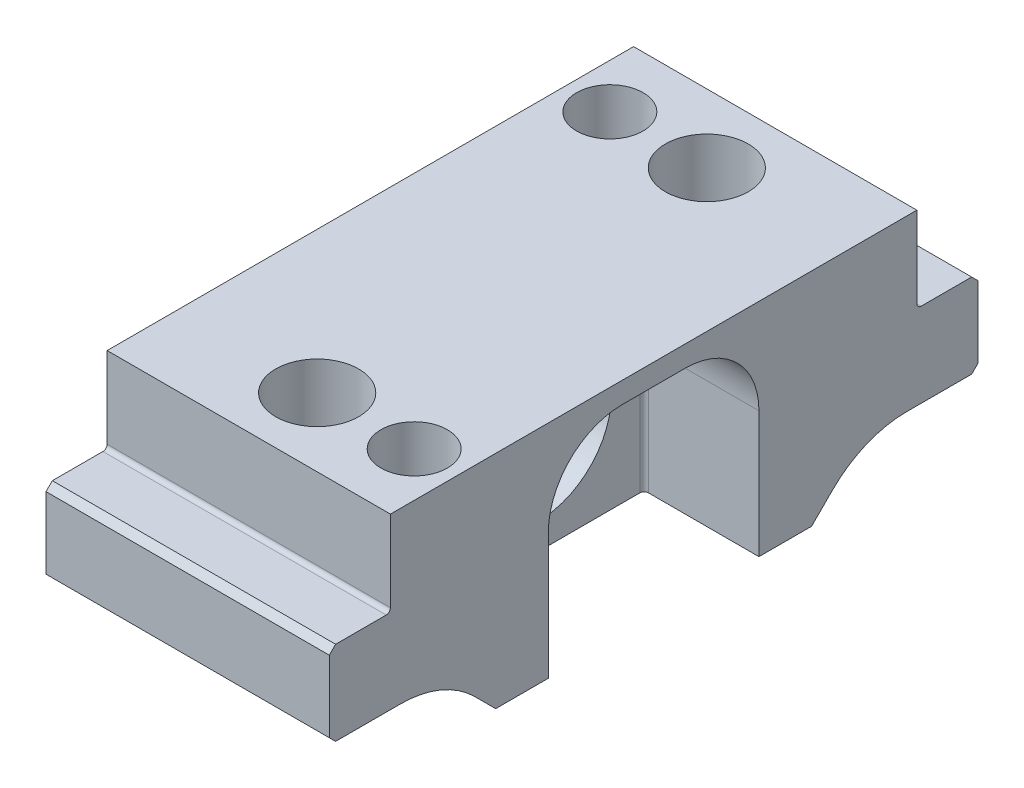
ISO-10303-21;
HEADER;
FILE_DESCRIPTION(('STEP AP214'),'2;1');
FILE_NAME('part.step','',(''),(''),'','','');
FILE_SCHEMA(('AUTOMOTIVE_DESIGN { 1 0 10303 214 1 1 1 1 }'));
ENDSEC;
DATA;
#1=APPLICATION_CONTEXT('core data for automotive mechanical design processes');
#2=APPLICATION_PROTOCOL_DEFINITION('international standard','automotive_design',2000,#1);
#3=PRODUCT_CONTEXT('',#1,'mechanical');
#4=PRODUCT('Part','Part','',(#3));
#5=PRODUCT_RELATED_PRODUCT_CATEGORY('part','',(#4));
#6=PRODUCT_DEFINITION_FORMATION('','',#4);
#7=PRODUCT_DEFINITION_CONTEXT('part definition',#1,'design');
#8=PRODUCT_DEFINITION('design','',#6,#7);
#9=PRODUCT_DEFINITION_SHAPE('','',#8);
#10=(LENGTH_UNIT() NAMED_UNIT(*) SI_UNIT(.MILLI.,.METRE.));
#11=(NAMED_UNIT(*) PLANE_ANGLE_UNIT() SI_UNIT($,.RADIAN.));
#12=(NAMED_UNIT(*) SI_UNIT($,.STERADIAN.) SOLID_ANGLE_UNIT());
#13=UNCERTAINTY_MEASURE_WITH_UNIT(LENGTH_MEASURE(1.E-05),#10,'distance_accuracy_value','');
#14=(GEOMETRIC_REPRESENTATION_CONTEXT(3) GLOBAL_UNCERTAINTY_ASSIGNED_CONTEXT((#13)) GLOBAL_UNIT_ASSIGNED_CONTEXT((#10,
#11,#12)) REPRESENTATION_CONTEXT('',''));
#15=CARTESIAN_POINT('',(0.,0.,0.));
#16=DIRECTION('',(0.,0.,1.));
#17=DIRECTION('',(1.,0.,0.));
#18=AXIS2_PLACEMENT_3D('',#15,#16,#17);
#19=CARTESIAN_POINT('',(-17.0815,13.335,40.64));
#20=DIRECTION('',(1.,0.,0.));
#21=DIRECTION('',(0.,1.,0.));
#22=AXIS2_PLACEMENT_3D('',#19,#20,#21);
#23=PLANE('',#22);
#24=DIRECTION('',(0.,0.,1.));
#25=VECTOR('',#24,1.);
#26=CARTESIAN_POINT('',(-17.0815,-7.0993,39.116));
#27=LINE('',#26,#25);
#28=CARTESIAN_POINT('',(-17.0815,-7.0993,30.5462122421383));
#29=VERTEX_POINT('',#28);
#30=CARTESIAN_POINT('',(-17.0815,-7.0993,38.354));
#31=VERTEX_POINT('',#30);
#32=EDGE_CURVE('E757',#29,#31,#27,.T.);
#33=ORIENTED_EDGE('',*,*,#32,.T.);
#34=DIRECTION('',(0.,-0.707106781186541,-0.707106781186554));
#35=VECTOR('',#34,1.);
#36=CARTESIAN_POINT('',(-17.0815,-6.3373,39.116));
#37=LINE('',#36,#35);
#38=CARTESIAN_POINT('',(-17.0815,-6.3373,39.116));
#39=VERTEX_POINT('',#38);
#40=EDGE_CURVE('E909',#31,#39,#37,.F.);
#41=ORIENTED_EDGE('',*,*,#40,.T.);
#42=DIRECTION('',(0.,1.,0.));
#43=VECTOR('',#42,1.);
#44=CARTESIAN_POINT('',(-17.0815,3.048,39.116));
#45=LINE('',#44,#43);
#46=CARTESIAN_POINT('',(-17.0815,2.286,39.116));
#47=VERTEX_POINT('',#46);
#48=EDGE_CURVE('E762',#39,#47,#45,.T.);
#49=ORIENTED_EDGE('',*,*,#48,.T.);
#50=DIRECTION('',(0.,-0.707106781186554,0.707106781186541));
#51=VECTOR('',#50,1.);
#52=CARTESIAN_POINT('',(-17.0815,3.048,38.354));
#53=LINE('',#52,#51);
#54=CARTESIAN_POINT('',(-17.0815,3.048,38.354));
#55=VERTEX_POINT('',#54);
#56=EDGE_CURVE('E907',#47,#55,#53,.F.);
#57=ORIENTED_EDGE('',*,*,#56,.T.);
#58=DIRECTION('',(0.,0.,-1.));
#59=VECTOR('',#58,1.);
#60=CARTESIAN_POINT('',(-17.0815,3.048,31.74365));
#61=LINE('',#60,#59);
#62=CARTESIAN_POINT('',(-17.0815,3.048,32.25165));
#63=VERTEX_POINT('',#62);
#64=EDGE_CURVE('E766',#55,#63,#61,.T.);
#65=ORIENTED_EDGE('',*,*,#64,.T.);
#66=CARTESIAN_POINT('',(-17.0815,3.556,32.25165));
#67=DIRECTION('',(1.,0.,0.));
#68=DIRECTION('',(0.,1.,0.));
#69=AXIS2_PLACEMENT_3D('',#66,#67,#68);
#70=CIRCLE('',#69,0.508);
#71=CARTESIAN_POINT('',(-17.0815,3.556,31.74365));
#72=VERTEX_POINT('',#71);
#73=EDGE_CURVE('E879',#63,#72,#70,.T.);
#74=ORIENTED_EDGE('',*,*,#73,.T.);
#75=DIRECTION('',(0.,1.,0.));
#76=VECTOR('',#75,1.);
#77=CARTESIAN_POINT('',(-17.0815,3.048,31.74365));
#78=LINE('',#77,#76);
#79=CARTESIAN_POINT('',(-17.0815,13.335,31.74365));
#80=VERTEX_POINT('',#79);
#81=EDGE_CURVE('E769',#72,#80,#78,.T.);
#82=ORIENTED_EDGE('',*,*,#81,.T.);
#83=DIRECTION('',(0.,0.,-1.));
#84=VECTOR('',#83,1.);
#85=CARTESIAN_POINT('',(-17.0815,13.335,40.64));
#86=LINE('',#85,#84);
#87=CARTESIAN_POINT('',(-17.0815,13.335,-31.74365));
#88=VERTEX_POINT('',#87);
#89=EDGE_CURVE('E802',#80,#88,#86,.T.);
#90=ORIENTED_EDGE('',*,*,#89,.T.);
#91=DIRECTION('',(0.,-1.,0.));
#92=VECTOR('',#91,1.);
#93=CARTESIAN_POINT('',(-17.0815,3.048,-31.74365));
#94=LINE('',#93,#92);
#95=CARTESIAN_POINT('',(-17.0815,3.556,-31.74365));
#96=VERTEX_POINT('',#95);
#97=EDGE_CURVE('E711',#88,#96,#94,.T.);
#98=ORIENTED_EDGE('',*,*,#97,.T.);
#99=CARTESIAN_POINT('',(-17.0815,3.556,-32.25165));
#100=DIRECTION('',(1.,0.,0.));
#101=DIRECTION('',(0.,1.,0.));
#102=AXIS2_PLACEMENT_3D('',#99,#100,#101);
#103=CIRCLE('',#102,0.508);
#104=CARTESIAN_POINT('',(-17.0815,3.048,-32.25165));
#105=VERTEX_POINT('',#104);
#106=EDGE_CURVE('E873',#96,#105,#103,.T.);
#107=ORIENTED_EDGE('',*,*,#106,.T.);
#108=DIRECTION('',(0.,0.,-1.));
#109=VECTOR('',#108,1.);
#110=CARTESIAN_POINT('',(-17.0815,3.048,-31.74365));
#111=LINE('',#110,#109);
#112=CARTESIAN_POINT('',(-17.0815,3.048,-38.354));
#113=VERTEX_POINT('',#112);
#114=EDGE_CURVE('E715',#105,#113,#111,.T.);
#115=ORIENTED_EDGE('',*,*,#114,.T.);
#116=DIRECTION('',(0.,0.707106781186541,0.707106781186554));
#117=VECTOR('',#116,1.);
#118=CARTESIAN_POINT('',(-17.0815,2.286,-39.116));
#119=LINE('',#118,#117);
#120=CARTESIAN_POINT('',(-17.0815,2.286,-39.116));
#121=VERTEX_POINT('',#120);
#122=EDGE_CURVE('E901',#113,#121,#119,.F.);
#123=ORIENTED_EDGE('',*,*,#122,.T.);
#124=DIRECTION('',(0.,-1.,0.));
#125=VECTOR('',#124,1.);
#126=CARTESIAN_POINT('',(-17.0815,3.048,-39.116));
#127=LINE('',#126,#125);
#128=CARTESIAN_POINT('',(-17.0815,-6.3373,-39.116));
#129=VERTEX_POINT('',#128);
#130=EDGE_CURVE('E720',#121,#129,#127,.T.);
#131=ORIENTED_EDGE('',*,*,#130,.T.);
#132=DIRECTION('',(0.,0.707106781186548,-0.707106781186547));
#133=VECTOR('',#132,1.);
#134=CARTESIAN_POINT('',(-17.0815,-7.0993,-38.354));
#135=LINE('',#134,#133);
#136=CARTESIAN_POINT('',(-17.0815,-7.0993,-38.354));
#137=VERTEX_POINT('',#136);
#138=EDGE_CURVE('E904',#129,#137,#135,.F.);
#139=ORIENTED_EDGE('',*,*,#138,.T.);
#140=DIRECTION('',(0.,0.,1.));
#141=VECTOR('',#140,1.);
#142=CARTESIAN_POINT('',(-17.0815,-7.0993,-39.116));
#143=LINE('',#142,#141);
#144=CARTESIAN_POINT('',(-17.0815,-7.0993,-30.5462122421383));
#145=VERTEX_POINT('',#144);
#146=EDGE_CURVE('E724',#137,#145,#143,.T.);
#147=ORIENTED_EDGE('',*,*,#146,.T.);
#148=CARTESIAN_POINT('',(-17.0815,-19.7993,-30.5462122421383));
#149=DIRECTION('',(1.,0.,0.));
#150=DIRECTION('',(0.,1.,0.));
#151=AXIS2_PLACEMENT_3D('',#148,#149,#150);
#152=CIRCLE('',#151,12.7);
#153=CARTESIAN_POINT('',(-17.0815,-10.8190438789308,-21.5659561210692));
#154=VERTEX_POINT('',#153);
#155=EDGE_CURVE('E830',#145,#154,#152,.T.);
#156=ORIENTED_EDGE('',*,*,#155,.T.);
#157=DIRECTION('',(0.,-0.707106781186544,0.707106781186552));
#158=VECTOR('',#157,1.);
#159=CARTESIAN_POINT('',(-17.0815,-13.335,-19.05));
#160=LINE('',#159,#158);
#161=CARTESIAN_POINT('',(-17.0815,-13.335,-19.05));
#162=VERTEX_POINT('',#161);
#163=EDGE_CURVE('E727',#154,#162,#160,.T.);
#164=ORIENTED_EDGE('',*,*,#163,.T.);
#165=DIRECTION('',(0.,0.,-1.));
#166=VECTOR('',#165,1.);
#167=CARTESIAN_POINT('',(-17.0815,-13.335,40.64));
#168=LINE('',#167,#166);
#169=CARTESIAN_POINT('',(-17.0815,-13.335,19.05));
#170=VERTEX_POINT('',#169);
#171=EDGE_CURVE('E798',#170,#162,#168,.T.);
#172=ORIENTED_EDGE('',*,*,#171,.F.);
#173=DIRECTION('',(0.,0.707106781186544,0.707106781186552));
#174=VECTOR('',#173,1.);
#175=CARTESIAN_POINT('',(-17.0815,-13.335,19.05));
#176=LINE('',#175,#174);
#177=CARTESIAN_POINT('',(-17.0815,-10.8190438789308,21.5659561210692));
#178=VERTEX_POINT('',#177);
#179=EDGE_CURVE('E753',#170,#178,#176,.T.);
#180=ORIENTED_EDGE('',*,*,#179,.T.);
#181=CARTESIAN_POINT('',(-17.0815,-19.7993,30.5462122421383));
#182=DIRECTION('',(1.,0.,0.));
#183=DIRECTION('',(0.,1.,0.));
#184=AXIS2_PLACEMENT_3D('',#181,#182,#183);
#185=CIRCLE('',#184,12.7);
#186=EDGE_CURVE('E835',#178,#29,#185,.T.);
#187=ORIENTED_EDGE('',*,*,#186,.T.);
#188=EDGE_LOOP('',(#33,#41,#49,#57,#65,#74,#82,#90,#98,#107,#115,#123,#131,#139,#147,#156,#164,
#172,#180,#187));
#189=FACE_BOUND('',#188,.T.);
#190=CARTESIAN_POINT('',(-17.0815,-1.4097,0.));
#191=DIRECTION('',(1.,0.,0.));
#192=DIRECTION('',(0.,0.,-1.));
#193=AXIS2_PLACEMENT_3D('',#190,#191,#192);
#194=CIRCLE('',#193,8.7503);
#195=CARTESIAN_POINT('',(-17.0815,-1.4097,-8.7503));
#196=VERTEX_POINT('',#195);
#197=EDGE_CURVE('E706',#196,#196,#194,.T.);
#198=ORIENTED_EDGE('',*,*,#197,.T.);
#199=EDGE_LOOP('',(#198));
#200=FACE_BOUND('',#199,.T.);
#201=DIRECTION('',(0.,1.,0.));
#202=VECTOR('',#201,1.);
#203=CARTESIAN_POINT('',(-17.0815,-4.30995240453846,17.3012273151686));
#204=LINE('',#203,#202);
#205=CARTESIAN_POINT('',(-17.0815,-4.30995240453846,17.3012273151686));
#206=VERTEX_POINT('',#205);
#207=CARTESIAN_POINT('',(-17.0815,2.04004759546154,17.3012273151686));
#208=VERTEX_POINT('',#207);
#209=EDGE_CURVE('E68',#206,#208,#204,.T.);
#210=ORIENTED_EDGE('',*,*,#209,.T.);
#211=DIRECTION('',(0.,0.,1.));
#212=VECTOR('',#211,1.);
#213=CARTESIAN_POINT('',(-17.0815,2.04004759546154,17.3012273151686));
#214=LINE('',#213,#212);
#215=CARTESIAN_POINT('',(-17.0815,2.04004759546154,18.5719905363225));
#216=VERTEX_POINT('',#215);
#217=EDGE_CURVE('E552',#208,#216,#214,.T.);
#218=ORIENTED_EDGE('',*,*,#217,.T.);
#219=CARTESIAN_POINT('',(-17.0815,2.04004759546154,18.5719905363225));
#220=CARTESIAN_POINT('',(-17.0815,2.0397653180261,18.6567922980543));
#221=CARTESIAN_POINT('',(-17.0815,2.0392233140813,18.8196210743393));
#222=CARTESIAN_POINT('',(-17.0815,2.03620114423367,19.0528897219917));
#223=CARTESIAN_POINT('',(-17.0815,2.0275390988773,19.2648474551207));
#224=CARTESIAN_POINT('',(-17.0815,2.02008495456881,19.4553834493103));
#225=CARTESIAN_POINT('',(-17.0815,2.00649243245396,19.6244942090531));
#226=CARTESIAN_POINT('',(-17.0815,1.99350097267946,19.7726982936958));
#227=CARTESIAN_POINT('',(-17.0815,1.97649447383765,19.8993131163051));
#228=CARTESIAN_POINT('',(-17.0815,1.9607003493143,19.9759591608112));
#229=CARTESIAN_POINT('',(-17.0815,1.95354919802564,20.0106624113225));
#230=B_SPLINE_CURVE_WITH_KNOTS('',3,(#219,#220,#221,#222,#223,#224,#225,#226,#227,#228,#229),
.UNSPECIFIED.,.F.,.F.,(4,1,1,1,1,1,1,1,4),(0.,0.176257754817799,0.338434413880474,
0.484822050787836,0.617157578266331,0.734698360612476,0.83738518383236,0.926372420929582,1.),.UNSPECIFIED.);
#231=CARTESIAN_POINT('',(-17.0815,1.95354919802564,20.0106624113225));
#232=VERTEX_POINT('',#231);
#233=EDGE_CURVE('E556',#216,#232,#230,.T.);
#234=ORIENTED_EDGE('',*,*,#233,.T.);
#235=CARTESIAN_POINT('',(-17.0815,1.95354919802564,20.0106624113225));
#236=CARTESIAN_POINT('',(-17.0815,1.94207063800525,20.057120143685));
#237=CARTESIAN_POINT('',(-17.0815,1.91935838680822,20.1490445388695));
#238=CARTESIAN_POINT('',(-17.0815,1.87135311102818,20.2813968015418));
#239=CARTESIAN_POINT('',(-17.0815,1.81580036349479,20.4075156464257));
#240=CARTESIAN_POINT('',(-17.0815,1.75055189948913,20.526877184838));
#241=CARTESIAN_POINT('',(-17.0815,1.67512337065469,20.6388835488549));
#242=CARTESIAN_POINT('',(-17.0815,1.59081691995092,20.7446896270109));
#243=CARTESIAN_POINT('',(-17.0815,1.4980938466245,20.8447755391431));
#244=CARTESIAN_POINT('',(-17.0815,1.39461634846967,20.9350936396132));
#245=CARTESIAN_POINT('',(-17.0815,1.28605582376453,21.0202544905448));
#246=CARTESIAN_POINT('',(-17.0815,1.16866472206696,21.0920795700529));
#247=CARTESIAN_POINT('',(-17.0815,1.04590737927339,21.1539947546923));
#248=CARTESIAN_POINT('',(-17.0815,0.916535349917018,21.2032898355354));
#249=CARTESIAN_POINT('',(-17.0815,0.781803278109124,21.2429827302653));
#250=CARTESIAN_POINT('',(-17.0815,0.640490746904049,21.2709703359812));
#251=CARTESIAN_POINT('',(-17.0815,0.493241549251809,21.2877546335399));
#252=CARTESIAN_POINT('',(-17.0815,0.392806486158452,21.2894634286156));
#253=CARTESIAN_POINT('',(-17.0815,0.341880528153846,21.2903298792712));
#254=B_SPLINE_CURVE_WITH_KNOTS('',3,(#235,#236,#237,#238,#239,#240,#241,#242,#243,#244,#245,
#246,#247,#248,#249,#250,#251,#252,#253),.UNSPECIFIED.,.F.,.F.,(4,1,1,1,1,1,1,1,1,1,1,1,1,1,1,1,
4),(0.,0.0642168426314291,0.127063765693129,0.188744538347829,0.24913210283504,
0.309452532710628,0.369826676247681,0.430650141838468,0.492351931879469,0.554072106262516,
0.615689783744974,0.676797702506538,0.738439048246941,0.801316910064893,0.865184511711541,
0.931641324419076,1.),.UNSPECIFIED.);
#255=CARTESIAN_POINT('',(-17.0815,0.341880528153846,21.2903298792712));
#256=VERTEX_POINT('',#255);
#257=EDGE_CURVE('E562',#232,#256,#254,.T.);
#258=ORIENTED_EDGE('',*,*,#257,.T.);
#259=CARTESIAN_POINT('',(-17.0815,0.341880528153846,21.2903298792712));
#260=CARTESIAN_POINT('',(-17.0815,0.257271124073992,21.2876646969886));
#261=CARTESIAN_POINT('',(-17.0815,0.0921762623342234,21.282464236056));
#262=CARTESIAN_POINT('',(-17.0815,-0.147419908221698,21.2339772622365));
#263=CARTESIAN_POINT('',(-17.0815,-0.370920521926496,21.1545541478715));
#264=CARTESIAN_POINT('',(-17.0815,-0.578044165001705,21.0451104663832));
#265=CARTESIAN_POINT('',(-17.0815,-0.764753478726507,20.9057379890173));
#266=CARTESIAN_POINT('',(-17.0815,-0.928747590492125,20.7382344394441));
#267=CARTESIAN_POINT('',(-17.0815,-1.06598000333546,20.5425063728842));
#268=CARTESIAN_POINT('',(-17.0815,-1.16114437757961,20.3602988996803));
#269=CARTESIAN_POINT('',(-17.0815,-1.22209151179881,20.1993459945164));
#270=CARTESIAN_POINT('',(-17.0815,-1.2649746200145,20.0668426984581));
#271=CARTESIAN_POINT('',(-17.0815,-1.29810704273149,19.9223040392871));
#272=CARTESIAN_POINT('',(-17.0815,-1.32778899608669,19.7671148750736));
#273=CARTESIAN_POINT('',(-17.0815,-1.35019849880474,19.6006293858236));
#274=CARTESIAN_POINT('',(-17.0815,-1.36661160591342,19.4232466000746));
#275=CARTESIAN_POINT('',(-17.0815,-1.3768696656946,19.2348400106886));
#276=CARTESIAN_POINT('',(-17.0815,-1.37839730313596,19.1054105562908));
#277=CARTESIAN_POINT('',(-17.0815,-1.37918317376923,19.038827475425));
#278=B_SPLINE_CURVE_WITH_KNOTS('',3,(#259,#260,#261,#262,#263,#264,#265,#266,#267,#268,#269,
#270,#271,#272,#273,#274,#275,#276,#277),.UNSPECIFIED.,.F.,.F.,(4,1,1,1,1,1,1,1,1,1,1,1,1,1,1,1,
4),(0.,0.0787802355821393,0.153720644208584,0.226713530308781,0.299191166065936,
0.371189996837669,0.443006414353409,0.51668917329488,0.593217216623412,0.633872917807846,
0.676989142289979,0.722899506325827,0.771958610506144,0.824211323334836,0.879378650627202,
0.937948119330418,1.),.UNSPECIFIED.);
#279=CARTESIAN_POINT('',(-17.0815,-1.37918317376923,19.038827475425));
#280=VERTEX_POINT('',#279);
#281=EDGE_CURVE('E571',#256,#280,#278,.T.);
#282=ORIENTED_EDGE('',*,*,#281,.T.);
#283=DIRECTION('',(0.,-0.782390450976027,0.622788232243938));
#284=VECTOR('',#283,1.);
#285=CARTESIAN_POINT('',(-17.0815,-1.37918317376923,19.038827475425));
#286=LINE('',#285,#284);
#287=CARTESIAN_POINT('',(-17.0815,-4.30995240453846,21.3717401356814));
#288=VERTEX_POINT('',#287);
#289=EDGE_CURVE('E580',#280,#288,#286,.T.);
#290=ORIENTED_EDGE('',*,*,#289,.T.);
#291=DIRECTION('',(0.,0.,-1.));
#292=VECTOR('',#291,1.);
#293=CARTESIAN_POINT('',(-17.0815,-4.30995240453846,21.3717401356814));
#294=LINE('',#293,#292);
#295=CARTESIAN_POINT('',(-17.0815,-4.30995240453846,20.6670326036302));
#296=VERTEX_POINT('',#295);
#297=EDGE_CURVE('E587',#288,#296,#294,.T.);
#298=ORIENTED_EDGE('',*,*,#297,.T.);
#299=DIRECTION('',(0.,0.782390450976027,-0.622788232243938));
#300=VECTOR('',#299,1.);
#301=CARTESIAN_POINT('',(-17.0815,-4.30995240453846,20.6670326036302));
#302=LINE('',#301,#300);
#303=CARTESIAN_POINT('',(-17.0815,-1.37918317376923,18.3341199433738));
#304=VERTEX_POINT('',#303);
#305=EDGE_CURVE('E591',#296,#304,#302,.T.);
#306=ORIENTED_EDGE('',*,*,#305,.T.);
#307=DIRECTION('',(0.,0.,-1.));
#308=VECTOR('',#307,1.);
#309=CARTESIAN_POINT('',(-17.0815,-1.37918317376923,18.3341199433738));
#310=LINE('',#309,#308);
#311=CARTESIAN_POINT('',(-17.0815,-1.37918317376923,17.8710991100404));
#312=VERTEX_POINT('',#311);
#313=EDGE_CURVE('E595',#304,#312,#310,.T.);
#314=ORIENTED_EDGE('',*,*,#313,.T.);
#315=DIRECTION('',(0.,-1.,0.));
#316=VECTOR('',#315,1.);
#317=CARTESIAN_POINT('',(-17.0815,-1.37918317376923,17.8710991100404));
#318=LINE('',#317,#316);
#319=CARTESIAN_POINT('',(-17.0815,-4.30995240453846,17.8710991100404));
#320=VERTEX_POINT('',#319);
#321=EDGE_CURVE('E599',#312,#320,#318,.T.);
#322=ORIENTED_EDGE('',*,*,#321,.T.);
#323=DIRECTION('',(0.,0.,-1.));
#324=VECTOR('',#323,1.);
#325=CARTESIAN_POINT('',(-17.0815,-4.30995240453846,17.8710991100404));
#326=LINE('',#325,#324);
#327=EDGE_CURVE('E603',#320,#206,#326,.T.);
#328=ORIENTED_EDGE('',*,*,#327,.T.);
#329=EDGE_LOOP('',(#210,#218,#234,#258,#282,#290,#298,#306,#314,#322,#328));
#330=FACE_BOUND('',#329,.T.);
#331=ADVANCED_FACE('F44',(#189,#200,#330),#23,.F.);
#332=CARTESIAN_POINT('',(-17.0815,-1.4097,0.));
#333=DIRECTION('',(1.,0.,0.));
#334=DIRECTION('',(0.,0.,-1.));
#335=AXIS2_PLACEMENT_3D('',#332,#333,#334);
#336=CYLINDRICAL_SURFACE('',#335,8.7503);
#337=ORIENTED_EDGE('',*,*,#197,.F.);
#338=EDGE_LOOP('',(#337));
#339=FACE_BOUND('',#338,.T.);
#340=CARTESIAN_POINT('',(3.2385,-1.4097,0.));
#341=DIRECTION('',(1.,0.,0.));
#342=DIRECTION('',(0.,1.,0.));
#343=AXIS2_PLACEMENT_3D('',#340,#341,#342);
#344=CIRCLE('',#343,8.7503);
#345=CARTESIAN_POINT('',(3.2385,7.3406,0.));
#346=VERTEX_POINT('',#345);
#347=EDGE_CURVE('E705',#346,#346,#344,.F.);
#348=ORIENTED_EDGE('',*,*,#347,.F.);
#349=EDGE_LOOP('',(#348));
#350=FACE_BOUND('',#349,.T.);
#351=ADVANCED_FACE('F1009',(#339,#350),#336,.F.);
#352=CARTESIAN_POINT('',(17.0815,13.335,40.64));
#353=DIRECTION('',(0.,-1.,0.));
#354=DIRECTION('',(0.,0.,-1.));
#355=AXIS2_PLACEMENT_3D('',#352,#353,#354);
#356=PLANE('',#355);
#357=CARTESIAN_POINT('',(11.7,13.335,23.5));
#358=DIRECTION('',(0.,1.,0.));
#359=DIRECTION('',(1.,0.,0.));
#360=AXIS2_PLACEMENT_3D('',#357,#358,#359);
#361=CIRCLE('',#360,4.00939);
#362=CARTESIAN_POINT('',(15.70939,13.335,23.5));
#363=VERTEX_POINT('',#362);
#364=EDGE_CURVE('E640',#363,#363,#361,.T.);
#365=ORIENTED_EDGE('',*,*,#364,.F.);
#366=EDGE_LOOP('',(#365));
#367=FACE_BOUND('',#366,.T.);
#368=CARTESIAN_POINT('',(-11.7,13.335,-23.5));
#369=DIRECTION('',(0.,1.,0.));
#370=DIRECTION('',(-1.,0.,0.));
#371=AXIS2_PLACEMENT_3D('',#368,#369,#370);
#372=CIRCLE('',#371,4.00939);
#373=CARTESIAN_POINT('',(-15.70939,13.335,-23.5));
#374=VERTEX_POINT('',#373);
#375=EDGE_CURVE('E645',#374,#374,#372,.T.);
#376=ORIENTED_EDGE('',*,*,#375,.F.);
#377=EDGE_LOOP('',(#376));
#378=FACE_BOUND('',#377,.T.);
#379=CARTESIAN_POINT('',(0.,13.335,-23.495));
#380=DIRECTION('',(0.,1.,0.));
#381=DIRECTION('',(0.,0.,1.));
#382=AXIS2_PLACEMENT_3D('',#379,#380,#381);
#383=CIRCLE('',#382,5.);
#384=CARTESIAN_POINT('',(0.,13.335,-18.495));
#385=VERTEX_POINT('',#384);
#386=EDGE_CURVE('E653',#385,#385,#383,.T.);
#387=ORIENTED_EDGE('',*,*,#386,.F.);
#388=EDGE_LOOP('',(#387));
#389=FACE_BOUND('',#388,.T.);
#390=CARTESIAN_POINT('',(0.,13.335,23.495));
#391=DIRECTION('',(0.,1.,0.));
#392=DIRECTION('',(0.,0.,1.));
#393=AXIS2_PLACEMENT_3D('',#390,#391,#392);
#394=CIRCLE('',#393,5.);
#395=CARTESIAN_POINT('',(0.,13.335,28.495));
#396=VERTEX_POINT('',#395);
#397=EDGE_CURVE('E671',#396,#396,#394,.T.);
#398=ORIENTED_EDGE('',*,*,#397,.F.);
#399=EDGE_LOOP('',(#398));
#400=FACE_BOUND('',#399,.T.);
#401=DIRECTION('',(0.,0.,-1.));
#402=VECTOR('',#401,1.);
#403=CARTESIAN_POINT('',(17.0815,13.335,40.64));
#404=LINE('',#403,#402);
#405=CARTESIAN_POINT('',(17.0815,13.335,31.74365));
#406=VERTEX_POINT('',#405);
#407=CARTESIAN_POINT('',(17.0815,13.335,-31.74365));
#408=VERTEX_POINT('',#407);
#409=EDGE_CURVE('E788',#406,#408,#404,.T.);
#410=ORIENTED_EDGE('',*,*,#409,.T.);
#411=DIRECTION('',(1.,0.,0.));
#412=VECTOR('',#411,1.);
#413=CARTESIAN_POINT('',(-17.0815,13.335,-31.74365));
#414=LINE('',#413,#412);
#415=EDGE_CURVE('E730',#88,#408,#414,.T.);
#416=ORIENTED_EDGE('',*,*,#415,.F.);
#417=ORIENTED_EDGE('',*,*,#89,.F.);
#418=DIRECTION('',(1.,0.,0.));
#419=VECTOR('',#418,1.);
#420=CARTESIAN_POINT('',(-17.0815,13.335,31.74365));
#421=LINE('',#420,#419);
#422=EDGE_CURVE('E784',#80,#406,#421,.T.);
#423=ORIENTED_EDGE('',*,*,#422,.T.);
#424=EDGE_LOOP('',(#410,#416,#417,#423));
#425=FACE_BOUND('',#424,.T.);
#426=ADVANCED_FACE('F1012',(#367,#378,#389,#400,#425),#356,.F.);
#427=CARTESIAN_POINT('',(-17.0815,-13.335,40.64));
#428=DIRECTION('',(0.,1.,0.));
#429=DIRECTION('',(0.,0.,1.));
#430=AXIS2_PLACEMENT_3D('',#427,#428,#429);
#431=PLANE('',#430);
#432=DIRECTION('',(1.,0.,0.));
#433=VECTOR('',#432,1.);
#434=CARTESIAN_POINT('',(-52.1160101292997,-13.335,-12.7));
#435=LINE('',#434,#433);
#436=CARTESIAN_POINT('',(3.74650000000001,-13.335,-12.7));
#437=VERTEX_POINT('',#436);
#438=CARTESIAN_POINT('',(17.0815,-13.335,-12.7));
#439=VERTEX_POINT('',#438);
#440=EDGE_CURVE('E699',#437,#439,#435,.T.);
#441=ORIENTED_EDGE('',*,*,#440,.F.);
#442=CARTESIAN_POINT('',(3.74650000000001,-13.335,-12.192));
#443=DIRECTION('',(0.,1.,0.));
#444=DIRECTION('',(0.,0.,1.));
#445=AXIS2_PLACEMENT_3D('',#442,#443,#444);
#446=CIRCLE('',#445,0.508);
#447=CARTESIAN_POINT('',(3.23850000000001,-13.335,-12.192));
#448=VERTEX_POINT('',#447);
#449=EDGE_CURVE('E957',#437,#448,#446,.T.);
#450=ORIENTED_EDGE('',*,*,#449,.T.);
#451=DIRECTION('',(0.,0.,1.));
#452=VECTOR('',#451,1.);
#453=CARTESIAN_POINT('',(3.23850000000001,-13.335,12.7));
#454=LINE('',#453,#452);
#455=CARTESIAN_POINT('',(3.23850000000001,-13.335,12.192));
#456=VERTEX_POINT('',#455);
#457=EDGE_CURVE('E701',#448,#456,#454,.T.);
#458=ORIENTED_EDGE('',*,*,#457,.T.);
#459=CARTESIAN_POINT('',(3.74650000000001,-13.335,12.192));
#460=DIRECTION('',(0.,1.,0.));
#461=DIRECTION('',(0.,0.,1.));
#462=AXIS2_PLACEMENT_3D('',#459,#460,#461);
#463=CIRCLE('',#462,0.508);
#464=CARTESIAN_POINT('',(3.74650000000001,-13.335,12.7));
#465=VERTEX_POINT('',#464);
#466=EDGE_CURVE('E959',#456,#465,#463,.T.);
#467=ORIENTED_EDGE('',*,*,#466,.T.);
#468=DIRECTION('',(1.,0.,0.));
#469=VECTOR('',#468,1.);
#470=CARTESIAN_POINT('',(-52.1160101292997,-13.335,12.7));
#471=LINE('',#470,#469);
#472=CARTESIAN_POINT('',(17.0815,-13.335,12.7));
#473=VERTEX_POINT('',#472);
#474=EDGE_CURVE('E698',#465,#473,#471,.T.);
#475=ORIENTED_EDGE('',*,*,#474,.T.);
#476=DIRECTION('',(0.,0.,-1.));
#477=VECTOR('',#476,1.);
#478=CARTESIAN_POINT('',(17.0815,-13.335,40.64));
#479=LINE('',#478,#477);
#480=CARTESIAN_POINT('',(17.0815,-13.335,19.05));
#481=VERTEX_POINT('',#480);
#482=EDGE_CURVE('E795',#481,#473,#479,.T.);
#483=ORIENTED_EDGE('',*,*,#482,.F.);
#484=DIRECTION('',(1.,0.,0.));
#485=VECTOR('',#484,1.);
#486=CARTESIAN_POINT('',(-17.0815,-13.335,19.05));
#487=LINE('',#486,#485);
#488=EDGE_CURVE('E772',#170,#481,#487,.T.);
#489=ORIENTED_EDGE('',*,*,#488,.F.);
#490=ORIENTED_EDGE('',*,*,#171,.T.);
#491=DIRECTION('',(1.,0.,0.));
#492=VECTOR('',#491,1.);
#493=CARTESIAN_POINT('',(-17.0815,-13.335,-19.05));
#494=LINE('',#493,#492);
#495=CARTESIAN_POINT('',(17.0815,-13.335,-19.05));
#496=VERTEX_POINT('',#495);
#497=EDGE_CURVE('E746',#162,#496,#494,.T.);
#498=ORIENTED_EDGE('',*,*,#497,.T.);
#499=EDGE_CURVE('E794',#439,#496,#479,.T.);
#500=ORIENTED_EDGE('',*,*,#499,.F.);
#501=EDGE_LOOP('',(#441,#450,#458,#467,#475,#483,#489,#490,#498,#500));
#502=FACE_BOUND('',#501,.T.);
#503=ADVANCED_FACE('F1056',(#502),#431,.F.);
#504=CARTESIAN_POINT('',(17.0815,-13.335,40.64));
#505=DIRECTION('',(-1.,0.,0.));
#506=DIRECTION('',(0.,-1.,0.));
#507=AXIS2_PLACEMENT_3D('',#504,#505,#506);
#508=PLANE('',#507);
#509=DIRECTION('',(0.,1.,0.));
#510=VECTOR('',#509,1.);
#511=CARTESIAN_POINT('',(17.0815,3.048,39.116));
#512=LINE('',#511,#510);
#513=CARTESIAN_POINT('',(17.0815,-6.33729999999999,39.116));
#514=VERTEX_POINT('',#513);
#515=CARTESIAN_POINT('',(17.0815,2.286,39.116));
#516=VERTEX_POINT('',#515);
#517=EDGE_CURVE('E778',#514,#516,#512,.T.);
#518=ORIENTED_EDGE('',*,*,#517,.F.);
#519=DIRECTION('',(0.,0.707106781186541,0.707106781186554));
#520=VECTOR('',#519,1.);
#521=CARTESIAN_POINT('',(17.0815,-6.33729999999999,39.116));
#522=LINE('',#521,#520);
#523=CARTESIAN_POINT('',(17.0815,-7.0993,38.354));
#524=VERTEX_POINT('',#523);
#525=EDGE_CURVE('E896',#514,#524,#522,.F.);
#526=ORIENTED_EDGE('',*,*,#525,.T.);
#527=DIRECTION('',(0.,0.,1.));
#528=VECTOR('',#527,1.);
#529=CARTESIAN_POINT('',(17.0815,-7.0993,39.116));
#530=LINE('',#529,#528);
#531=CARTESIAN_POINT('',(17.0815,-7.0993,30.5462122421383));
#532=VERTEX_POINT('',#531);
#533=EDGE_CURVE('E775',#532,#524,#530,.T.);
#534=ORIENTED_EDGE('',*,*,#533,.F.);
#535=CARTESIAN_POINT('',(17.0815,-19.7993,30.5462122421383));
#536=DIRECTION('',(-1.,0.,0.));
#537=DIRECTION('',(0.,-1.,0.));
#538=AXIS2_PLACEMENT_3D('',#535,#536,#537);
#539=CIRCLE('',#538,12.7);
#540=CARTESIAN_POINT('',(17.0815,-10.8190438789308,21.5659561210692));
#541=VERTEX_POINT('',#540);
#542=EDGE_CURVE('E833',#532,#541,#539,.T.);
#543=ORIENTED_EDGE('',*,*,#542,.T.);
#544=DIRECTION('',(0.,0.707106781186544,0.707106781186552));
#545=VECTOR('',#544,1.);
#546=CARTESIAN_POINT('',(17.0815,-13.335,19.05));
#547=LINE('',#546,#545);
#548=EDGE_CURVE('E750',#481,#541,#547,.T.);
#549=ORIENTED_EDGE('',*,*,#548,.F.);
#550=ORIENTED_EDGE('',*,*,#482,.T.);
#551=DIRECTION('',(0.,-1.,0.));
#552=VECTOR('',#551,1.);
#553=CARTESIAN_POINT('',(17.0815,-13.335,12.7));
#554=LINE('',#553,#552);
#555=CARTESIAN_POINT('',(17.0815,1.905,12.7));
#556=VERTEX_POINT('',#555);
#557=EDGE_CURVE('E687',#556,#473,#554,.T.);
#558=ORIENTED_EDGE('',*,*,#557,.F.);
#559=CARTESIAN_POINT('',(17.0815,1.905,3.81));
#560=DIRECTION('',(-1.,0.,0.));
#561=DIRECTION('',(0.,-1.,0.));
#562=AXIS2_PLACEMENT_3D('',#559,#560,#561);
#563=CIRCLE('',#562,8.89);
#564=CARTESIAN_POINT('',(17.0815,10.795,3.81));
#565=VERTEX_POINT('',#564);
#566=EDGE_CURVE('E852',#556,#565,#563,.T.);
#567=ORIENTED_EDGE('',*,*,#566,.T.);
#568=DIRECTION('',(0.,0.,1.));
#569=VECTOR('',#568,1.);
#570=CARTESIAN_POINT('',(17.0815,10.795,12.7));
#571=LINE('',#570,#569);
#572=CARTESIAN_POINT('',(17.0815,10.795,-3.81));
#573=VERTEX_POINT('',#572);
#574=EDGE_CURVE('E694',#573,#565,#571,.T.);
#575=ORIENTED_EDGE('',*,*,#574,.F.);
#576=CARTESIAN_POINT('',(17.0815,1.905,-3.81));
#577=DIRECTION('',(-1.,0.,0.));
#578=DIRECTION('',(0.,-1.,0.));
#579=AXIS2_PLACEMENT_3D('',#576,#577,#578);
#580=CIRCLE('',#579,8.89);
#581=CARTESIAN_POINT('',(17.0815,1.905,-12.7));
#582=VERTEX_POINT('',#581);
#583=EDGE_CURVE('E850',#573,#582,#580,.T.);
#584=ORIENTED_EDGE('',*,*,#583,.T.);
#585=DIRECTION('',(0.,1.,0.));
#586=VECTOR('',#585,1.);
#587=CARTESIAN_POINT('',(17.0815,-13.335,-12.7));
#588=LINE('',#587,#586);
#589=EDGE_CURVE('E690',#439,#582,#588,.T.);
#590=ORIENTED_EDGE('',*,*,#589,.F.);
#591=ORIENTED_EDGE('',*,*,#499,.T.);
#592=DIRECTION('',(0.,-0.707106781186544,0.707106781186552));
#593=VECTOR('',#592,1.);
#594=CARTESIAN_POINT('',(17.0815,-13.335,-19.05));
#595=LINE('',#594,#593);
#596=CARTESIAN_POINT('',(17.0815,-10.8190438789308,-21.5659561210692));
#597=VERTEX_POINT('',#596);
#598=EDGE_CURVE('E716',#597,#496,#595,.T.);
#599=ORIENTED_EDGE('',*,*,#598,.F.);
#600=CARTESIAN_POINT('',(17.0815,-19.7993,-30.5462122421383));
#601=DIRECTION('',(-1.,0.,0.));
#602=DIRECTION('',(0.,-1.,0.));
#603=AXIS2_PLACEMENT_3D('',#600,#601,#602);
#604=CIRCLE('',#603,12.7);
#605=CARTESIAN_POINT('',(17.0815,-7.0993,-30.5462122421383));
#606=VERTEX_POINT('',#605);
#607=EDGE_CURVE('E826',#597,#606,#604,.T.);
#608=ORIENTED_EDGE('',*,*,#607,.T.);
#609=DIRECTION('',(0.,0.,1.));
#610=VECTOR('',#609,1.);
#611=CARTESIAN_POINT('',(17.0815,-7.0993,-39.116));
#612=LINE('',#611,#610);
#613=CARTESIAN_POINT('',(17.0815,-7.0993,-38.354));
#614=VERTEX_POINT('',#613);
#615=EDGE_CURVE('E742',#614,#606,#612,.T.);
#616=ORIENTED_EDGE('',*,*,#615,.F.);
#617=DIRECTION('',(0.,-0.707106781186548,0.707106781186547));
#618=VECTOR('',#617,1.);
#619=CARTESIAN_POINT('',(17.0815,-7.09929999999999,-38.354));
#620=LINE('',#619,#618);
#621=CARTESIAN_POINT('',(17.0815,-6.3373,-39.116));
#622=VERTEX_POINT('',#621);
#623=EDGE_CURVE('E891',#614,#622,#620,.F.);
#624=ORIENTED_EDGE('',*,*,#623,.T.);
#625=DIRECTION('',(0.,-1.,0.));
#626=VECTOR('',#625,1.);
#627=CARTESIAN_POINT('',(17.0815,3.048,-39.116));
#628=LINE('',#627,#626);
#629=CARTESIAN_POINT('',(17.0815,2.286,-39.116));
#630=VERTEX_POINT('',#629);
#631=EDGE_CURVE('E738',#630,#622,#628,.T.);
#632=ORIENTED_EDGE('',*,*,#631,.F.);
#633=DIRECTION('',(0.,-0.707106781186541,-0.707106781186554));
#634=VECTOR('',#633,1.);
#635=CARTESIAN_POINT('',(17.0815,2.286,-39.116));
#636=LINE('',#635,#634);
#637=CARTESIAN_POINT('',(17.0815,3.048,-38.354));
#638=VERTEX_POINT('',#637);
#639=EDGE_CURVE('E888',#630,#638,#636,.F.);
#640=ORIENTED_EDGE('',*,*,#639,.T.);
#641=DIRECTION('',(0.,0.,-1.));
#642=VECTOR('',#641,1.);
#643=CARTESIAN_POINT('',(17.0815,3.048,-31.74365));
#644=LINE('',#643,#642);
#645=CARTESIAN_POINT('',(17.0815,3.048,-32.25165));
#646=VERTEX_POINT('',#645);
#647=EDGE_CURVE('E734',#646,#638,#644,.T.);
#648=ORIENTED_EDGE('',*,*,#647,.F.);
#649=CARTESIAN_POINT('',(17.0815,3.556,-32.25165));
#650=DIRECTION('',(-1.,0.,0.));
#651=DIRECTION('',(0.,-1.,0.));
#652=AXIS2_PLACEMENT_3D('',#649,#650,#651);
#653=CIRCLE('',#652,0.508);
#654=CARTESIAN_POINT('',(17.0815,3.556,-31.74365));
#655=VERTEX_POINT('',#654);
#656=EDGE_CURVE('E870',#646,#655,#653,.T.);
#657=ORIENTED_EDGE('',*,*,#656,.T.);
#658=DIRECTION('',(0.,-1.,0.));
#659=VECTOR('',#658,1.);
#660=CARTESIAN_POINT('',(17.0815,3.048,-31.74365));
#661=LINE('',#660,#659);
#662=EDGE_CURVE('E710',#408,#655,#661,.T.);
#663=ORIENTED_EDGE('',*,*,#662,.F.);
#664=ORIENTED_EDGE('',*,*,#409,.F.);
#665=DIRECTION('',(0.,1.,0.));
#666=VECTOR('',#665,1.);
#667=CARTESIAN_POINT('',(17.0815,3.048,31.74365));
#668=LINE('',#667,#666);
#669=CARTESIAN_POINT('',(17.0815,3.556,31.74365));
#670=VERTEX_POINT('',#669);
#671=EDGE_CURVE('E758',#670,#406,#668,.T.);
#672=ORIENTED_EDGE('',*,*,#671,.F.);
#673=CARTESIAN_POINT('',(17.0815,3.556,32.25165));
#674=DIRECTION('',(-1.,0.,0.));
#675=DIRECTION('',(0.,-1.,0.));
#676=AXIS2_PLACEMENT_3D('',#673,#674,#675);
#677=CIRCLE('',#676,0.508);
#678=CARTESIAN_POINT('',(17.0815,3.048,32.25165));
#679=VERTEX_POINT('',#678);
#680=EDGE_CURVE('E876',#670,#679,#677,.T.);
#681=ORIENTED_EDGE('',*,*,#680,.T.);
#682=DIRECTION('',(0.,0.,-1.));
#683=VECTOR('',#682,1.);
#684=CARTESIAN_POINT('',(17.0815,3.048,31.74365));
#685=LINE('',#684,#683);
#686=CARTESIAN_POINT('',(17.0815,3.048,38.354));
#687=VERTEX_POINT('',#686);
#688=EDGE_CURVE('E781',#687,#679,#685,.T.);
#689=ORIENTED_EDGE('',*,*,#688,.F.);
#690=DIRECTION('',(0.,0.707106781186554,-0.707106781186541));
#691=VECTOR('',#690,1.);
#692=CARTESIAN_POINT('',(17.0815,3.048,38.354));
#693=LINE('',#692,#691);
#694=EDGE_CURVE('E894',#687,#516,#693,.F.);
#695=ORIENTED_EDGE('',*,*,#694,.T.);
#696=EDGE_LOOP('',(#518,#526,#534,#543,#549,#550,#558,#567,#575,#584,#590,#591,#599,#608,#616,
#624,#632,#640,#648,#657,#663,#664,#672,#681,#689,#695));
#697=FACE_BOUND('',#696,.T.);
#698=ADVANCED_FACE('F1038',(#697),#508,.F.);
#699=CARTESIAN_POINT('',(-17.0815,3.048,31.74365));
#700=DIRECTION('',(0.,0.,-1.));
#701=DIRECTION('',(-1.,0.,0.));
#702=AXIS2_PLACEMENT_3D('',#699,#700,#701);
#703=PLANE('',#702);
#704=ORIENTED_EDGE('',*,*,#81,.F.);
#705=DIRECTION('',(1.,0.,0.));
#706=VECTOR('',#705,1.);
#707=CARTESIAN_POINT('',(17.0815,3.556,31.74365));
#708=LINE('',#707,#706);
#709=EDGE_CURVE('E862',#72,#670,#708,.T.);
#710=ORIENTED_EDGE('',*,*,#709,.T.);
#711=ORIENTED_EDGE('',*,*,#671,.T.);
#712=ORIENTED_EDGE('',*,*,#422,.F.);
#713=EDGE_LOOP('',(#704,#710,#711,#712));
#714=FACE_BOUND('',#713,.T.);
#715=ADVANCED_FACE('F1034',(#714),#703,.F.);
#716=CARTESIAN_POINT('',(-17.0815,3.048,31.74365));
#717=DIRECTION('',(0.,-1.,0.));
#718=DIRECTION('',(0.,0.,-1.));
#719=AXIS2_PLACEMENT_3D('',#716,#717,#718);
#720=PLANE('',#719);
#721=ORIENTED_EDGE('',*,*,#64,.F.);
#722=DIRECTION('',(1.,0.,0.));
#723=VECTOR('',#722,1.);
#724=CARTESIAN_POINT('',(-17.0815,3.048,38.354));
#725=LINE('',#724,#723);
#726=EDGE_CURVE('E912',#55,#687,#725,.T.);
#727=ORIENTED_EDGE('',*,*,#726,.T.);
#728=ORIENTED_EDGE('',*,*,#688,.T.);
#729=DIRECTION('',(1.,0.,0.));
#730=VECTOR('',#729,1.);
#731=CARTESIAN_POINT('',(-17.0815,3.048,32.25165));
#732=LINE('',#731,#730);
#733=EDGE_CURVE('E866',#679,#63,#732,.F.);
#734=ORIENTED_EDGE('',*,*,#733,.T.);
#735=EDGE_LOOP('',(#721,#727,#728,#734));
#736=FACE_BOUND('',#735,.T.);
#737=ADVANCED_FACE('F1037',(#736),#720,.F.);
#738=CARTESIAN_POINT('',(-17.0815,3.048,39.116));
#739=DIRECTION('',(0.,0.,-1.));
#740=DIRECTION('',(-1.,0.,0.));
#741=AXIS2_PLACEMENT_3D('',#738,#739,#740);
#742=PLANE('',#741);
#743=ORIENTED_EDGE('',*,*,#48,.F.);
#744=DIRECTION('',(1.,0.,0.));
#745=VECTOR('',#744,1.);
#746=CARTESIAN_POINT('',(-17.0815,-6.3373,39.116));
#747=LINE('',#746,#745);
#748=EDGE_CURVE('E884',#39,#514,#747,.T.);
#749=ORIENTED_EDGE('',*,*,#748,.T.);
#750=ORIENTED_EDGE('',*,*,#517,.T.);
#751=DIRECTION('',(-1.,0.,0.));
#752=VECTOR('',#751,1.);
#753=CARTESIAN_POINT('',(-17.0815,2.286,39.116));
#754=LINE('',#753,#752);
#755=EDGE_CURVE('E882',#516,#47,#754,.T.);
#756=ORIENTED_EDGE('',*,*,#755,.T.);
#757=EDGE_LOOP('',(#743,#749,#750,#756));
#758=FACE_BOUND('',#757,.T.);
#759=ADVANCED_FACE('F1042',(#758),#742,.F.);
#760=CARTESIAN_POINT('',(-17.0815,-7.0993,39.116));
#761=DIRECTION('',(0.,1.,0.));
#762=DIRECTION('',(0.,0.,1.));
#763=AXIS2_PLACEMENT_3D('',#760,#761,#762);
#764=PLANE('',#763);
#765=ORIENTED_EDGE('',*,*,#533,.T.);
#766=DIRECTION('',(-1.,0.,0.));
#767=VECTOR('',#766,1.);
#768=CARTESIAN_POINT('',(-17.0815,-7.0993,38.354));
#769=LINE('',#768,#767);
#770=EDGE_CURVE('E898',#524,#31,#769,.T.);
#771=ORIENTED_EDGE('',*,*,#770,.T.);
#772=ORIENTED_EDGE('',*,*,#32,.F.);
#773=DIRECTION('',(1.,0.,0.));
#774=VECTOR('',#773,1.);
#775=CARTESIAN_POINT('',(17.0815,-7.0993,30.5462122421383));
#776=LINE('',#775,#774);
#777=EDGE_CURVE('E818',#29,#532,#776,.T.);
#778=ORIENTED_EDGE('',*,*,#777,.T.);
#779=EDGE_LOOP('',(#765,#771,#772,#778));
#780=FACE_BOUND('',#779,.T.);
#781=ADVANCED_FACE('F1046',(#780),#764,.F.);
#782=CARTESIAN_POINT('',(-17.0815,-13.335,19.05));
#783=DIRECTION('',(0.,0.707106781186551,-0.707106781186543));
#784=DIRECTION('',(0.,0.707106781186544,0.707106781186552));
#785=AXIS2_PLACEMENT_3D('',#782,#783,#784);
#786=PLANE('',#785);
#787=DIRECTION('',(1.,0.,0.));
#788=VECTOR('',#787,1.);
#789=CARTESIAN_POINT('',(-17.0815,-10.8190438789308,21.5659561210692));
#790=LINE('',#789,#788);
#791=CARTESIAN_POINT('',(3.78698953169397,-10.8190438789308,21.5659561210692));
#792=VERTEX_POINT('',#791);
#793=EDGE_CURVE('E823',#541,#792,#790,.F.);
#794=ORIENTED_EDGE('',*,*,#793,.T.);
#795=CARTESIAN_POINT('',(0.,-8.89000000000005,23.495));
#796=DIRECTION('',(0.,0.707106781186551,-0.707106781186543));
#797=DIRECTION('',(0.,0.707106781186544,0.707106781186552));
#798=AXIS2_PLACEMENT_3D('',#795,#796,#797);
#799=ELLIPSE('',#798,6.01040764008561,4.25);
#800=CARTESIAN_POINT('',(-3.78698953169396,-10.8190438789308,21.5659561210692));
#801=VERTEX_POINT('',#800);
#802=EDGE_CURVE('E682',#792,#801,#799,.T.);
#803=ORIENTED_EDGE('',*,*,#802,.T.);
#804=EDGE_CURVE('E822',#801,#178,#790,.F.);
#805=ORIENTED_EDGE('',*,*,#804,.T.);
#806=ORIENTED_EDGE('',*,*,#179,.F.);
#807=ORIENTED_EDGE('',*,*,#488,.T.);
#808=ORIENTED_EDGE('',*,*,#548,.T.);
#809=EDGE_LOOP('',(#794,#803,#805,#806,#807,#808));
#810=FACE_BOUND('',#809,.T.);
#811=ADVANCED_FACE('F1018',(#810),#786,.F.);
#812=CARTESIAN_POINT('',(-17.0815,-13.335,-19.05));
#813=DIRECTION('',(0.,0.707106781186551,0.707106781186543));
#814=DIRECTION('',(0.,-0.707106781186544,0.707106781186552));
#815=AXIS2_PLACEMENT_3D('',#812,#813,#814);
#816=PLANE('',#815);
#817=DIRECTION('',(1.,0.,0.));
#818=VECTOR('',#817,1.);
#819=CARTESIAN_POINT('',(17.0815,-10.8190438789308,-21.5659561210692));
#820=LINE('',#819,#818);
#821=CARTESIAN_POINT('',(-3.78698953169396,-10.8190438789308,-21.5659561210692));
#822=VERTEX_POINT('',#821);
#823=EDGE_CURVE('E810',#154,#822,#820,.T.);
#824=ORIENTED_EDGE('',*,*,#823,.T.);
#825=CARTESIAN_POINT('',(0.,-8.89000000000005,-23.495));
#826=DIRECTION('',(0.,0.707106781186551,0.707106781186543));
#827=DIRECTION('',(0.,0.707106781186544,-0.707106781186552));
#828=AXIS2_PLACEMENT_3D('',#825,#826,#827);
#829=ELLIPSE('',#828,6.01040764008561,4.25);
#830=CARTESIAN_POINT('',(3.78698953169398,-10.8190438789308,-21.5659561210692));
#831=VERTEX_POINT('',#830);
#832=EDGE_CURVE('E668',#822,#831,#829,.T.);
#833=ORIENTED_EDGE('',*,*,#832,.T.);
#834=EDGE_CURVE('E806',#831,#597,#820,.T.);
#835=ORIENTED_EDGE('',*,*,#834,.T.);
#836=ORIENTED_EDGE('',*,*,#598,.T.);
#837=ORIENTED_EDGE('',*,*,#497,.F.);
#838=ORIENTED_EDGE('',*,*,#163,.F.);
#839=EDGE_LOOP('',(#824,#833,#835,#836,#837,#838));
#840=FACE_BOUND('',#839,.T.);
#841=ADVANCED_FACE('F1014',(#840),#816,.F.);
#842=CARTESIAN_POINT('',(-17.0815,-7.0993,-39.116));
#843=DIRECTION('',(0.,1.,0.));
#844=DIRECTION('',(0.,0.,1.));
#845=AXIS2_PLACEMENT_3D('',#842,#843,#844);
#846=PLANE('',#845);
#847=ORIENTED_EDGE('',*,*,#146,.F.);
#848=DIRECTION('',(1.,0.,0.));
#849=VECTOR('',#848,1.);
#850=CARTESIAN_POINT('',(-17.0815,-7.0993,-38.354));
#851=LINE('',#850,#849);
#852=EDGE_CURVE('E916',#137,#614,#851,.T.);
#853=ORIENTED_EDGE('',*,*,#852,.T.);
#854=ORIENTED_EDGE('',*,*,#615,.T.);
#855=DIRECTION('',(1.,0.,0.));
#856=VECTOR('',#855,1.);
#857=CARTESIAN_POINT('',(-17.0815,-7.0993,-30.5462122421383));
#858=LINE('',#857,#856);
#859=EDGE_CURVE('E814',#606,#145,#858,.F.);
#860=ORIENTED_EDGE('',*,*,#859,.T.);
#861=EDGE_LOOP('',(#847,#853,#854,#860));
#862=FACE_BOUND('',#861,.T.);
#863=ADVANCED_FACE('F1017',(#862),#846,.F.);
#864=CARTESIAN_POINT('',(-17.0815,3.048,-39.116));
#865=DIRECTION('',(0.,0.,1.));
#866=DIRECTION('',(1.,0.,0.));
#867=AXIS2_PLACEMENT_3D('',#864,#865,#866);
#868=PLANE('',#867);
#869=ORIENTED_EDGE('',*,*,#631,.T.);
#870=DIRECTION('',(-1.,0.,0.));
#871=VECTOR('',#870,1.);
#872=CARTESIAN_POINT('',(-17.0815,-6.3373,-39.116));
#873=LINE('',#872,#871);
#874=EDGE_CURVE('E924',#622,#129,#873,.T.);
#875=ORIENTED_EDGE('',*,*,#874,.T.);
#876=ORIENTED_EDGE('',*,*,#130,.F.);
#877=DIRECTION('',(1.,0.,0.));
#878=VECTOR('',#877,1.);
#879=CARTESIAN_POINT('',(-17.0815,2.286,-39.116));
#880=LINE('',#879,#878);
#881=EDGE_CURVE('E920',#121,#630,#880,.T.);
#882=ORIENTED_EDGE('',*,*,#881,.T.);
#883=EDGE_LOOP('',(#869,#875,#876,#882));
#884=FACE_BOUND('',#883,.T.);
#885=ADVANCED_FACE('F1022',(#884),#868,.F.);
#886=CARTESIAN_POINT('',(-17.0815,3.048,-31.74365));
#887=DIRECTION('',(0.,-1.,0.));
#888=DIRECTION('',(0.,0.,-1.));
#889=AXIS2_PLACEMENT_3D('',#886,#887,#888);
#890=PLANE('',#889);
#891=ORIENTED_EDGE('',*,*,#647,.T.);
#892=DIRECTION('',(-1.,0.,0.));
#893=VECTOR('',#892,1.);
#894=CARTESIAN_POINT('',(-17.0815,3.048,-38.354));
#895=LINE('',#894,#893);
#896=EDGE_CURVE('E927',#638,#113,#895,.T.);
#897=ORIENTED_EDGE('',*,*,#896,.T.);
#898=ORIENTED_EDGE('',*,*,#114,.F.);
#899=DIRECTION('',(1.,0.,0.));
#900=VECTOR('',#899,1.);
#901=CARTESIAN_POINT('',(17.0815,3.048,-32.25165));
#902=LINE('',#901,#900);
#903=EDGE_CURVE('E855',#105,#646,#902,.T.);
#904=ORIENTED_EDGE('',*,*,#903,.T.);
#905=EDGE_LOOP('',(#891,#897,#898,#904));
#906=FACE_BOUND('',#905,.T.);
#907=ADVANCED_FACE('F1026',(#906),#890,.F.);
#908=CARTESIAN_POINT('',(-17.0815,3.048,-31.74365));
#909=DIRECTION('',(0.,0.,1.));
#910=DIRECTION('',(1.,0.,0.));
#911=AXIS2_PLACEMENT_3D('',#908,#909,#910);
#912=PLANE('',#911);
#913=ORIENTED_EDGE('',*,*,#662,.T.);
#914=DIRECTION('',(1.,0.,0.));
#915=VECTOR('',#914,1.);
#916=CARTESIAN_POINT('',(-17.0815,3.556,-31.74365));
#917=LINE('',#916,#915);
#918=EDGE_CURVE('E859',#655,#96,#917,.F.);
#919=ORIENTED_EDGE('',*,*,#918,.T.);
#920=ORIENTED_EDGE('',*,*,#97,.F.);
#921=ORIENTED_EDGE('',*,*,#415,.T.);
#922=EDGE_LOOP('',(#913,#919,#920,#921));
#923=FACE_BOUND('',#922,.T.);
#924=ADVANCED_FACE('F995',(#923),#912,.F.);
#925=CARTESIAN_POINT('',(3.23850000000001,13.335,40.64));
#926=DIRECTION('',(1.,0.,0.));
#927=DIRECTION('',(0.,1.,0.));
#928=AXIS2_PLACEMENT_3D('',#925,#926,#927);
#929=PLANE('',#928);
#930=ORIENTED_EDGE('',*,*,#457,.F.);
#931=DIRECTION('',(0.,-1.,0.));
#932=VECTOR('',#931,1.);
#933=CARTESIAN_POINT('',(3.23850000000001,13.335,-12.192));
#934=LINE('',#933,#932);
#935=CARTESIAN_POINT('',(3.2385,1.905,-12.192));
#936=VERTEX_POINT('',#935);
#937=EDGE_CURVE('E944',#448,#936,#934,.F.);
#938=ORIENTED_EDGE('',*,*,#937,.T.);
#939=CARTESIAN_POINT('',(3.2385,1.905,-3.81));
#940=DIRECTION('',(1.,0.,0.));
#941=DIRECTION('',(0.,1.,0.));
#942=AXIS2_PLACEMENT_3D('',#939,#940,#941);
#943=CIRCLE('',#942,8.382);
#944=CARTESIAN_POINT('',(3.23850000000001,10.287,-3.81));
#945=VERTEX_POINT('',#944);
#946=EDGE_CURVE('E942',#936,#945,#943,.T.);
#947=ORIENTED_EDGE('',*,*,#946,.T.);
#948=DIRECTION('',(0.,0.,-1.));
#949=VECTOR('',#948,1.);
#950=CARTESIAN_POINT('',(3.23850000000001,10.287,40.64));
#951=LINE('',#950,#949);
#952=CARTESIAN_POINT('',(3.23850000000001,10.287,3.81));
#953=VERTEX_POINT('',#952);
#954=EDGE_CURVE('E939',#945,#953,#951,.F.);
#955=ORIENTED_EDGE('',*,*,#954,.T.);
#956=CARTESIAN_POINT('',(3.2385,1.905,3.81));
#957=DIRECTION('',(1.,0.,0.));
#958=DIRECTION('',(0.,1.,0.));
#959=AXIS2_PLACEMENT_3D('',#956,#957,#958);
#960=CIRCLE('',#959,8.382);
#961=CARTESIAN_POINT('',(3.2385,1.905,12.192));
#962=VERTEX_POINT('',#961);
#963=EDGE_CURVE('E936',#953,#962,#960,.T.);
#964=ORIENTED_EDGE('',*,*,#963,.T.);
#965=DIRECTION('',(0.,1.,0.));
#966=VECTOR('',#965,1.);
#967=CARTESIAN_POINT('',(3.23850000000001,13.335,12.192));
#968=LINE('',#967,#966);
#969=EDGE_CURVE('E933',#962,#456,#968,.F.);
#970=ORIENTED_EDGE('',*,*,#969,.T.);
#971=EDGE_LOOP('',(#930,#938,#947,#955,#964,#970));
#972=FACE_BOUND('',#971,.T.);
#973=ORIENTED_EDGE('',*,*,#347,.T.);
#974=EDGE_LOOP('',(#973));
#975=FACE_BOUND('',#974,.T.);
#976=ADVANCED_FACE('F991',(#972,#975),#929,.T.);
#977=CARTESIAN_POINT('',(-52.1160101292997,-13.335,12.7));
#978=DIRECTION('',(0.,0.,1.));
#979=DIRECTION('',(1.,0.,0.));
#980=AXIS2_PLACEMENT_3D('',#977,#978,#979);
#981=PLANE('',#980);
#982=ORIENTED_EDGE('',*,*,#474,.F.);
#983=DIRECTION('',(0.,1.,0.));
#984=VECTOR('',#983,1.);
#985=CARTESIAN_POINT('',(3.74650000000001,-13.335,12.7));
#986=LINE('',#985,#984);
#987=CARTESIAN_POINT('',(3.74650000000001,1.905,12.7));
#988=VERTEX_POINT('',#987);
#989=EDGE_CURVE('E954',#465,#988,#986,.T.);
#990=ORIENTED_EDGE('',*,*,#989,.T.);
#991=DIRECTION('',(1.,0.,0.));
#992=VECTOR('',#991,1.);
#993=CARTESIAN_POINT('',(17.0815,1.905,12.7));
#994=LINE('',#993,#992);
#995=EDGE_CURVE('E847',#988,#556,#994,.T.);
#996=ORIENTED_EDGE('',*,*,#995,.T.);
#997=ORIENTED_EDGE('',*,*,#557,.T.);
#998=EDGE_LOOP('',(#982,#990,#996,#997));
#999=FACE_BOUND('',#998,.T.);
#1000=ADVANCED_FACE('F994',(#999),#981,.F.);
#1001=CARTESIAN_POINT('',(-52.1160101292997,10.795,12.7));
#1002=DIRECTION('',(0.,1.,0.));
#1003=DIRECTION('',(0.,0.,1.));
#1004=AXIS2_PLACEMENT_3D('',#1001,#1002,#1003);
#1005=PLANE('',#1004);
#1006=DIRECTION('',(1.,0.,0.));
#1007=VECTOR('',#1006,1.);
#1008=CARTESIAN_POINT('',(3.23850000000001,10.795,3.81));
#1009=LINE('',#1008,#1007);
#1010=CARTESIAN_POINT('',(3.74650000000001,10.795,3.81));
#1011=VERTEX_POINT('',#1010);
#1012=EDGE_CURVE('E838',#565,#1011,#1009,.F.);
#1013=ORIENTED_EDGE('',*,*,#1012,.T.);
#1014=DIRECTION('',(0.,0.,-1.));
#1015=VECTOR('',#1014,1.);
#1016=CARTESIAN_POINT('',(3.74650000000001,10.795,12.7));
#1017=LINE('',#1016,#1015);
#1018=CARTESIAN_POINT('',(3.74650000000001,10.795,-3.81));
#1019=VERTEX_POINT('',#1018);
#1020=EDGE_CURVE('E948',#1011,#1019,#1017,.T.);
#1021=ORIENTED_EDGE('',*,*,#1020,.T.);
#1022=DIRECTION('',(1.,0.,0.));
#1023=VECTOR('',#1022,1.);
#1024=CARTESIAN_POINT('',(17.0815,10.795,-3.81));
#1025=LINE('',#1024,#1023);
#1026=EDGE_CURVE('E842',#1019,#573,#1025,.T.);
#1027=ORIENTED_EDGE('',*,*,#1026,.T.);
#1028=ORIENTED_EDGE('',*,*,#574,.T.);
#1029=EDGE_LOOP('',(#1013,#1021,#1027,#1028));
#1030=FACE_BOUND('',#1029,.T.);
#1031=ADVANCED_FACE('F997',(#1030),#1005,.F.);
#1032=CARTESIAN_POINT('',(-52.1160101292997,-13.335,-12.7));
#1033=DIRECTION('',(0.,0.,-1.));
#1034=DIRECTION('',(-1.,0.,0.));
#1035=AXIS2_PLACEMENT_3D('',#1032,#1033,#1034);
#1036=PLANE('',#1035);
#1037=DIRECTION('',(1.,0.,0.));
#1038=VECTOR('',#1037,1.);
#1039=CARTESIAN_POINT('',(3.23850000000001,1.905,-12.7));
#1040=LINE('',#1039,#1038);
#1041=CARTESIAN_POINT('',(3.74650000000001,1.905,-12.7));
#1042=VERTEX_POINT('',#1041);
#1043=EDGE_CURVE('E844',#582,#1042,#1040,.F.);
#1044=ORIENTED_EDGE('',*,*,#1043,.T.);
#1045=DIRECTION('',(0.,-1.,0.));
#1046=VECTOR('',#1045,1.);
#1047=CARTESIAN_POINT('',(3.74650000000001,-13.335,-12.7));
#1048=LINE('',#1047,#1046);
#1049=EDGE_CURVE('E930',#1042,#437,#1048,.T.);
#1050=ORIENTED_EDGE('',*,*,#1049,.T.);
#1051=ORIENTED_EDGE('',*,*,#440,.T.);
#1052=ORIENTED_EDGE('',*,*,#589,.T.);
#1053=EDGE_LOOP('',(#1044,#1050,#1051,#1052));
#1054=FACE_BOUND('',#1053,.T.);
#1055=ADVANCED_FACE('F1000',(#1054),#1036,.F.);
#1056=CARTESIAN_POINT('',(-17.0815,-19.7993,-30.5462122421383));
#1057=DIRECTION('',(-1.,0.,0.));
#1058=DIRECTION('',(0.,0.,1.));
#1059=AXIS2_PLACEMENT_3D('',#1056,#1057,#1058);
#1060=CYLINDRICAL_SURFACE('',#1059,12.7);
#1061=ORIENTED_EDGE('',*,*,#834,.F.);
#1062=CARTESIAN_POINT('',(3.78698953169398,-10.8190438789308,-21.5659561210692));
#1063=CARTESIAN_POINT('',(3.84769401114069,-10.6998052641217,-21.6851703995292));
#1064=CARTESIAN_POINT('',(3.90326235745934,-10.5816087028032,-21.8081392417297));
#1065=CARTESIAN_POINT('',(4.00323310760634,-10.3479815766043,-22.0613912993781));
#1066=CARTESIAN_POINT('',(4.04761917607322,-10.2325552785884,-22.1916848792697));
#1067=CARTESIAN_POINT('',(4.12442693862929,-10.004679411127,-22.4600116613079));
#1068=CARTESIAN_POINT('',(4.15675962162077,-9.89225746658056,-22.5980940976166));
#1069=CARTESIAN_POINT('',(4.20777032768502,-9.6722392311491,-22.8804037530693));
#1070=CARTESIAN_POINT('',(4.22645652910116,-9.56464008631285,-23.0246272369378));
#1071=CARTESIAN_POINT('',(4.24651034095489,-9.37729077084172,-23.2872877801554));
#1072=CARTESIAN_POINT('',(4.25070143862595,-9.2964571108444,-23.4047403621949));
#1073=CARTESIAN_POINT('',(4.24910750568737,-9.13883069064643,-23.6422501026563));
#1074=CARTESIAN_POINT('',(4.2433246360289,-9.06203705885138,-23.7623066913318));
#1075=CARTESIAN_POINT('',(4.22115687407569,-8.91312932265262,-24.0039360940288));
#1076=CARTESIAN_POINT('',(4.20479804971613,-8.84100419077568,-24.1255044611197));
#1077=CARTESIAN_POINT('',(4.16091101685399,-8.70166805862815,-24.3694579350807));
#1078=CARTESIAN_POINT('',(4.13338285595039,-8.63445703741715,-24.491843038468));
#1079=CARTESIAN_POINT('',(4.06637648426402,-8.50476758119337,-24.7373416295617));
#1080=CARTESIAN_POINT('',(4.02679432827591,-8.44233647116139,-24.8604519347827));
#1081=CARTESIAN_POINT('',(3.9354359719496,-8.32319780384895,-25.1049284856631));
#1082=CARTESIAN_POINT('',(3.88365945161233,-8.26649039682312,-25.2262946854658));
#1083=CARTESIAN_POINT('',(3.76779890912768,-8.15901656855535,-25.4657567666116));
#1084=CARTESIAN_POINT('',(3.70371461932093,-8.10825027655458,-25.5838525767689));
#1085=CARTESIAN_POINT('',(3.56338146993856,-8.01275199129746,-25.8151512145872));
#1086=CARTESIAN_POINT('',(3.48713445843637,-7.96801908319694,-25.9283547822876));
#1087=CARTESIAN_POINT('',(3.33356253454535,-7.88995323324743,-26.1339630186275));
#1088=CARTESIAN_POINT('',(3.25766280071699,-7.85589424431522,-26.2271598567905));
#1089=CARTESIAN_POINT('',(3.09739925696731,-7.79217929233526,-26.40758869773));
#1090=CARTESIAN_POINT('',(3.01303610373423,-7.76252298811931,-26.4948211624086));
#1091=CARTESIAN_POINT('',(2.83644281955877,-7.70743769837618,-26.6623172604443));
#1092=CARTESIAN_POINT('',(2.74421541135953,-7.68200725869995,-26.7425832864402));
#1093=CARTESIAN_POINT('',(2.55255340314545,-7.63512470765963,-26.8952915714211));
#1094=CARTESIAN_POINT('',(2.45311899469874,-7.61367249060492,-26.9677340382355));
#1095=CARTESIAN_POINT('',(2.25463202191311,-7.57577704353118,-27.0994932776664));
#1096=CARTESIAN_POINT('',(2.15599013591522,-7.55909619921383,-27.1593615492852));
#1097=CARTESIAN_POINT('',(1.95376970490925,-7.52873641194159,-27.2710600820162));
#1098=CARTESIAN_POINT('',(1.85018956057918,-7.5150584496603,-27.3228877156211));
#1099=CARTESIAN_POINT('',(1.63891308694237,-7.49049577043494,-27.4179936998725));
#1100=CARTESIAN_POINT('',(1.53121856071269,-7.47960984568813,-27.4612757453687));
#1101=CARTESIAN_POINT('',(1.31240358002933,-7.46041785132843,-27.5389560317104));
#1102=CARTESIAN_POINT('',(1.20128187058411,-7.45211273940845,-27.5733509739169));
#1103=CARTESIAN_POINT('',(0.977056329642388,-7.43795485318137,-27.6327821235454));
#1104=CARTESIAN_POINT('',(0.863966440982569,-7.43208907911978,-27.6578678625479));
#1105=CARTESIAN_POINT('',(0.635982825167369,-7.42261420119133,-27.6987414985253));
#1106=CARTESIAN_POINT('',(0.521088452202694,-7.41900592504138,-27.7145259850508));
#1107=CARTESIAN_POINT('',(0.290385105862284,-7.41396621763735,-27.7366506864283));
#1108=CARTESIAN_POINT('',(0.174576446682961,-7.41253406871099,-27.7429940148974));
#1109=CARTESIAN_POINT('',(-0.0572213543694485,-7.41180990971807,-27.7461958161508));
#1110=CARTESIAN_POINT('',(-0.173210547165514,-7.41251869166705,-27.7430507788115));
#1111=CARTESIAN_POINT('',(-0.405024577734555,-7.41610311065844,-27.7272584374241));
#1112=CARTESIAN_POINT('',(-0.520846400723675,-7.41898835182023,-27.7145690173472));
#1113=CARTESIAN_POINT('',(-0.751024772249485,-7.42700703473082,-27.67973605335));
#1114=CARTESIAN_POINT('',(-0.865380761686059,-7.43214130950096,-27.6575890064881));
#1115=CARTESIAN_POINT('',(-1.09172473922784,-7.44477291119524,-27.6040334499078));
#1116=CARTESIAN_POINT('',(-1.20371361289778,-7.45226933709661,-27.5726284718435));
#1117=CARTESIAN_POINT('',(-1.42460479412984,-7.46978752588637,-27.5008078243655));
#1118=CARTESIAN_POINT('',(-1.53350595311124,-7.47981021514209,-27.4603888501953));
#1119=CARTESIAN_POINT('',(-1.74723397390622,-7.50255678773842,-27.3709596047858));
#1120=CARTESIAN_POINT('',(-1.85206702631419,-7.51527635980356,-27.3219630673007));
#1121=CARTESIAN_POINT('',(-2.05709988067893,-7.54363860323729,-27.2157792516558));
#1122=CARTESIAN_POINT('',(-2.15729796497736,-7.55928234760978,-27.158588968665));
#1123=CARTESIAN_POINT('',(-2.44973725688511,-7.61093590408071,-26.9755182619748));
#1124=CARTESIAN_POINT('',(-2.63408781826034,-7.65169464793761,-26.8380266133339));
#1125=CARTESIAN_POINT('',(-2.97531409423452,-7.74729456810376,-26.5382563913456));
#1126=CARTESIAN_POINT('',(-3.13232070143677,-7.80206537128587,-26.3761032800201));
#1127=CARTESIAN_POINT('',(-3.41647482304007,-7.92700426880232,-26.0326859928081));
#1128=CARTESIAN_POINT('',(-3.54362005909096,-7.99717353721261,-25.8514203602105));
#1129=CARTESIAN_POINT('',(-3.76773203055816,-8.15442779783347,-25.4738007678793));
#1130=CARTESIAN_POINT('',(-3.864214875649,-8.24175187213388,-25.2772605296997));
#1131=CARTESIAN_POINT('',(-4.02422254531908,-8.43194547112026,-24.8785813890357));
#1132=CARTESIAN_POINT('',(-4.08775521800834,-8.53481128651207,-24.6764438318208));
#1133=CARTESIAN_POINT('',(-4.1870597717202,-8.76302715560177,-24.2571839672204));
#1134=CARTESIAN_POINT('',(-4.22035509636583,-8.88949181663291,-24.0400902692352));
#1135=CARTESIAN_POINT('',(-4.25384960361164,-9.15668152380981,-23.6116160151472));
#1136=CARTESIAN_POINT('',(-4.25396389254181,-9.29744222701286,-23.400251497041));
#1137=CARTESIAN_POINT('',(-4.22876804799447,-9.54950964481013,-23.0451955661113));
#1138=CARTESIAN_POINT('',(-4.2105119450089,-9.65813587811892,-22.8990160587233));
#1139=CARTESIAN_POINT('',(-4.15997914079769,-9.88039908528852,-22.6128503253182));
#1140=CARTESIAN_POINT('',(-4.1276918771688,-9.99403977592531,-22.472868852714));
#1141=CARTESIAN_POINT('',(-4.05057560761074,-10.2246593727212,-22.2006810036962));
#1142=CARTESIAN_POINT('',(-4.00581582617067,-10.3416167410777,-22.0684364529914));
#1143=CARTESIAN_POINT('',(-3.90477981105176,-10.5783763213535,-21.8115029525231));
#1144=CARTESIAN_POINT('',(-3.84852247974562,-10.6981735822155,-21.6868020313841));
#1145=CARTESIAN_POINT('',(-3.78698953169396,-10.8190438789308,-21.5659561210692));
#1146=B_SPLINE_CURVE_WITH_KNOTS('',3,(#1062,#1063,#1064,#1065,#1066,#1067,#1068,#1069,#1070,
#1071,#1072,#1073,#1074,#1075,#1076,#1077,#1078,#1079,#1080,#1081,#1082,#1083,#1084,#1085,#1086,
#1087,#1088,#1089,#1090,#1091,#1092,#1093,#1094,#1095,#1096,#1097,#1098,#1099,#1100,#1101,#1102,
#1103,#1104,#1105,#1106,#1107,#1108,#1109,#1110,#1111,#1112,#1113,#1114,#1115,#1116,#1117,#1118,
#1119,#1120,#1121,#1122,#1123,#1124,#1125,#1126,#1127,#1128,#1129,#1130,#1131,#1132,#1133,#1134,
#1135,#1136,#1137,#1138,#1139,#1140,#1141,#1142,#1143,#1144,#1145),.UNSPECIFIED.,.F.,.F.,(4,2,2,
2,2,2,2,2,2,2,2,2,2,2,2,2,2,2,2,2,2,2,2,2,2,2,2,2,2,2,2,2,2,2,2,2,2,2,2,2,2,4),(0.,
0.537600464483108,1.07598177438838,1.61826363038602,2.16022022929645,2.58775543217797,
3.01519801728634,3.44159102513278,3.86798221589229,4.29815974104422,4.72834855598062,
5.15854672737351,5.58867959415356,5.96296773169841,6.33722685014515,6.71135691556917,
7.08547703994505,7.4348248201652,7.78428652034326,8.1335967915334,8.48303653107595,
8.83058939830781,9.17826962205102,9.52583515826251,9.87352928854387,10.2227667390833,
10.5721336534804,10.9213674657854,11.2707295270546,11.619537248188,11.9684732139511,
12.6654920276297,13.3590766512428,14.0527141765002,14.756809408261,15.4607368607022,
16.218158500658,16.9775179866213,17.5259290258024,18.0747536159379,18.6205908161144,
19.1655377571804),.UNSPECIFIED.);
#1147=EDGE_CURVE('E12',#831,#822,#1146,.T.);
#1148=ORIENTED_EDGE('',*,*,#1147,.T.);
#1149=ORIENTED_EDGE('',*,*,#823,.F.);
#1150=ORIENTED_EDGE('',*,*,#155,.F.);
#1151=ORIENTED_EDGE('',*,*,#859,.F.);
#1152=ORIENTED_EDGE('',*,*,#607,.F.);
#1153=EDGE_LOOP('',(#1061,#1148,#1149,#1150,#1151,#1152));
#1154=FACE_BOUND('',#1153,.T.);
#1155=ADVANCED_FACE('F1004',(#1154),#1060,.F.);
#1156=CARTESIAN_POINT('',(-17.0815,-19.7993,30.5462122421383));
#1157=DIRECTION('',(-1.,0.,0.));
#1158=DIRECTION('',(0.,0.,1.));
#1159=AXIS2_PLACEMENT_3D('',#1156,#1157,#1158);
#1160=CYLINDRICAL_SURFACE('',#1159,12.7);
#1161=ORIENTED_EDGE('',*,*,#804,.F.);
#1162=CARTESIAN_POINT('',(-3.78698953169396,-10.8190438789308,21.5659561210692));
#1163=CARTESIAN_POINT('',(-3.84769401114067,-10.6998052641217,21.6851703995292));
#1164=CARTESIAN_POINT('',(-3.90326235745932,-10.5816087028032,21.8081392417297));
#1165=CARTESIAN_POINT('',(-4.00323310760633,-10.3479815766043,22.0613912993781));
#1166=CARTESIAN_POINT('',(-4.04761917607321,-10.2325552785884,22.1916848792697));
#1167=CARTESIAN_POINT('',(-4.12442693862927,-10.004679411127,22.4600116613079));
#1168=CARTESIAN_POINT('',(-4.15675962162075,-9.89225746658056,22.5980940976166));
#1169=CARTESIAN_POINT('',(-4.20777032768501,-9.6722392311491,22.8804037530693));
#1170=CARTESIAN_POINT('',(-4.22645652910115,-9.56464008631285,23.0246272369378));
#1171=CARTESIAN_POINT('',(-4.24651034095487,-9.37729077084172,23.2872877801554));
#1172=CARTESIAN_POINT('',(-4.25070143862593,-9.29645711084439,23.4047403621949));
#1173=CARTESIAN_POINT('',(-4.24910750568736,-9.13883069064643,23.6422501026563));
#1174=CARTESIAN_POINT('',(-4.24332463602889,-9.06203705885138,23.7623066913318));
#1175=CARTESIAN_POINT('',(-4.22115687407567,-8.91312932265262,24.0039360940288));
#1176=CARTESIAN_POINT('',(-4.20479804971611,-8.84100419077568,24.1255044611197));
#1177=CARTESIAN_POINT('',(-4.16091101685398,-8.70166805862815,24.3694579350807));
#1178=CARTESIAN_POINT('',(-4.13338285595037,-8.63445703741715,24.491843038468));
#1179=CARTESIAN_POINT('',(-4.066376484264,-8.50476758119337,24.7373416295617));
#1180=CARTESIAN_POINT('',(-4.02679432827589,-8.44233647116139,24.8604519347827));
#1181=CARTESIAN_POINT('',(-3.93543597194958,-8.32319780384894,25.1049284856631));
#1182=CARTESIAN_POINT('',(-3.88365945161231,-8.26649039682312,25.2262946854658));
#1183=CARTESIAN_POINT('',(-3.76779890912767,-8.15901656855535,25.4657567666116));
#1184=CARTESIAN_POINT('',(-3.70371461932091,-8.10825027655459,25.5838525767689));
#1185=CARTESIAN_POINT('',(-3.56338146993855,-8.01275199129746,25.8151512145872));
#1186=CARTESIAN_POINT('',(-3.48713445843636,-7.96801908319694,25.9283547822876));
#1187=CARTESIAN_POINT('',(-3.33356253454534,-7.88995323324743,26.1339630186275));
#1188=CARTESIAN_POINT('',(-3.25766280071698,-7.85589424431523,26.2271598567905));
#1189=CARTESIAN_POINT('',(-3.0973992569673,-7.79217929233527,26.40758869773));
#1190=CARTESIAN_POINT('',(-3.01303610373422,-7.76252298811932,26.4948211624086));
#1191=CARTESIAN_POINT('',(-2.83644281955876,-7.70743769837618,26.6623172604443));
#1192=CARTESIAN_POINT('',(-2.74421541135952,-7.68200725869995,26.7425832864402));
#1193=CARTESIAN_POINT('',(-2.55255340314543,-7.63512470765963,26.8952915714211));
#1194=CARTESIAN_POINT('',(-2.45311899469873,-7.61367249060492,26.9677340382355));
#1195=CARTESIAN_POINT('',(-2.25463202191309,-7.57577704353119,27.0994932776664));
#1196=CARTESIAN_POINT('',(-2.1559901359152,-7.55909619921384,27.1593615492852));
#1197=CARTESIAN_POINT('',(-1.95376970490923,-7.52873641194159,27.2710600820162));
#1198=CARTESIAN_POINT('',(-1.85018956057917,-7.5150584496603,27.3228877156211));
#1199=CARTESIAN_POINT('',(-1.63891308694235,-7.49049577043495,27.4179936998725));
#1200=CARTESIAN_POINT('',(-1.53121856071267,-7.47960984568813,27.4612757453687));
#1201=CARTESIAN_POINT('',(-1.31240358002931,-7.46041785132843,27.5389560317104));
#1202=CARTESIAN_POINT('',(-1.20128187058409,-7.45211273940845,27.5733509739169));
#1203=CARTESIAN_POINT('',(-0.977056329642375,-7.43795485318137,27.6327821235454));
#1204=CARTESIAN_POINT('',(-0.863966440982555,-7.43208907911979,27.6578678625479));
#1205=CARTESIAN_POINT('',(-0.635982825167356,-7.42261420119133,27.6987414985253));
#1206=CARTESIAN_POINT('',(-0.521088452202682,-7.41900592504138,27.7145259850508));
#1207=CARTESIAN_POINT('',(-0.290385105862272,-7.41396621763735,27.7366506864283));
#1208=CARTESIAN_POINT('',(-0.174576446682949,-7.41253406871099,27.7429940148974));
#1209=CARTESIAN_POINT('',(0.0572213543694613,-7.41180990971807,27.7461958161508));
#1210=CARTESIAN_POINT('',(0.173210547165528,-7.41251869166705,27.7430507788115));
#1211=CARTESIAN_POINT('',(0.40502457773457,-7.41610311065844,27.7272584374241));
#1212=CARTESIAN_POINT('',(0.52084640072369,-7.41898835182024,27.7145690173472));
#1213=CARTESIAN_POINT('',(0.751024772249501,-7.42700703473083,27.67973605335));
#1214=CARTESIAN_POINT('',(0.865380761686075,-7.43214130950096,27.6575890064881));
#1215=CARTESIAN_POINT('',(1.09172473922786,-7.44477291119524,27.6040334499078));
#1216=CARTESIAN_POINT('',(1.20371361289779,-7.45226933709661,27.5726284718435));
#1217=CARTESIAN_POINT('',(1.42460479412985,-7.46978752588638,27.5008078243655));
#1218=CARTESIAN_POINT('',(1.53350595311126,-7.4798102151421,27.4603888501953));
#1219=CARTESIAN_POINT('',(1.74723397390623,-7.50255678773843,27.3709596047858));
#1220=CARTESIAN_POINT('',(1.8520670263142,-7.51527635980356,27.3219630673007));
#1221=CARTESIAN_POINT('',(2.05709988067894,-7.54363860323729,27.2157792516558));
#1222=CARTESIAN_POINT('',(2.15729796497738,-7.55928234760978,27.158588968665));
#1223=CARTESIAN_POINT('',(2.44973725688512,-7.61093590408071,26.9755182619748));
#1224=CARTESIAN_POINT('',(2.63408781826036,-7.65169464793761,26.8380266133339));
#1225=CARTESIAN_POINT('',(2.97531409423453,-7.74729456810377,26.5382563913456));
#1226=CARTESIAN_POINT('',(3.13232070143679,-7.80206537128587,26.3761032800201));
#1227=CARTESIAN_POINT('',(3.41647482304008,-7.92700426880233,26.0326859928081));
#1228=CARTESIAN_POINT('',(3.54362005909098,-7.99717353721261,25.8514203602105));
#1229=CARTESIAN_POINT('',(3.76773203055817,-8.15442779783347,25.4738007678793));
#1230=CARTESIAN_POINT('',(3.86421487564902,-8.24175187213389,25.2772605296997));
#1231=CARTESIAN_POINT('',(4.0242225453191,-8.43194547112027,24.8785813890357));
#1232=CARTESIAN_POINT('',(4.08775521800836,-8.53481128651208,24.6764438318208));
#1233=CARTESIAN_POINT('',(4.18705977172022,-8.76302715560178,24.2571839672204));
#1234=CARTESIAN_POINT('',(4.22035509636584,-8.88949181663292,24.0400902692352));
#1235=CARTESIAN_POINT('',(4.25384960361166,-9.15668152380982,23.6116160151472));
#1236=CARTESIAN_POINT('',(4.25396389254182,-9.29744222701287,23.400251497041));
#1237=CARTESIAN_POINT('',(4.22876804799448,-9.54950964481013,23.0451955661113));
#1238=CARTESIAN_POINT('',(4.21051194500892,-9.65813587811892,22.8990160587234));
#1239=CARTESIAN_POINT('',(4.1599791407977,-9.88039908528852,22.6128503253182));
#1240=CARTESIAN_POINT('',(4.12769187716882,-9.99403977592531,22.472868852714));
#1241=CARTESIAN_POINT('',(4.05057560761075,-10.2246593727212,22.2006810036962));
#1242=CARTESIAN_POINT('',(4.00581582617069,-10.3416167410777,22.0684364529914));
#1243=CARTESIAN_POINT('',(3.90477981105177,-10.5783763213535,21.8115029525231));
#1244=CARTESIAN_POINT('',(3.84852247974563,-10.6981735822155,21.6868020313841));
#1245=CARTESIAN_POINT('',(3.78698953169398,-10.8190438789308,21.5659561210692));
#1246=B_SPLINE_CURVE_WITH_KNOTS('',3,(#1162,#1163,#1164,#1165,#1166,#1167,#1168,#1169,#1170,
#1171,#1172,#1173,#1174,#1175,#1176,#1177,#1178,#1179,#1180,#1181,#1182,#1183,#1184,#1185,#1186,
#1187,#1188,#1189,#1190,#1191,#1192,#1193,#1194,#1195,#1196,#1197,#1198,#1199,#1200,#1201,#1202,
#1203,#1204,#1205,#1206,#1207,#1208,#1209,#1210,#1211,#1212,#1213,#1214,#1215,#1216,#1217,#1218,
#1219,#1220,#1221,#1222,#1223,#1224,#1225,#1226,#1227,#1228,#1229,#1230,#1231,#1232,#1233,#1234,
#1235,#1236,#1237,#1238,#1239,#1240,#1241,#1242,#1243,#1244,#1245),.UNSPECIFIED.,.F.,.F.,(4,2,2,
2,2,2,2,2,2,2,2,2,2,2,2,2,2,2,2,2,2,2,2,2,2,2,2,2,2,2,2,2,2,2,2,2,2,2,2,2,2,4),(0.,
0.537600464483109,1.07598177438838,1.61826363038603,2.16022022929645,2.58775543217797,
3.01519801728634,3.44159102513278,3.8679822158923,4.29815974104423,4.72834855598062,
5.15854672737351,5.58867959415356,5.96296773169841,6.33722685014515,6.71135691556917,
7.08547703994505,7.4348248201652,7.78428652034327,8.13359679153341,8.48303653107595,
8.83058939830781,9.17826962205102,9.52583515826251,9.87352928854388,10.2227667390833,
10.5721336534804,10.9213674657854,11.2707295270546,11.619537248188,11.9684732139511,
12.6654920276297,13.3590766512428,14.0527141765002,14.756809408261,15.4607368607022,
16.218158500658,16.9775179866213,17.5259290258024,18.0747536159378,18.6205908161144,
19.1655377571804),.UNSPECIFIED.);
#1247=EDGE_CURVE('E58',#801,#792,#1246,.T.);
#1248=ORIENTED_EDGE('',*,*,#1247,.T.);
#1249=ORIENTED_EDGE('',*,*,#793,.F.);
#1250=ORIENTED_EDGE('',*,*,#542,.F.);
#1251=ORIENTED_EDGE('',*,*,#777,.F.);
#1252=ORIENTED_EDGE('',*,*,#186,.F.);
#1253=EDGE_LOOP('',(#1161,#1248,#1249,#1250,#1251,#1252));
#1254=FACE_BOUND('',#1253,.T.);
#1255=ADVANCED_FACE('F979',(#1254),#1160,.F.);
#1256=CARTESIAN_POINT('',(-52.1160101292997,1.905,-3.81));
#1257=DIRECTION('',(-1.,0.,0.));
#1258=DIRECTION('',(0.,0.,1.));
#1259=AXIS2_PLACEMENT_3D('',#1256,#1257,#1258);
#1260=CYLINDRICAL_SURFACE('',#1259,8.89);
#1261=ORIENTED_EDGE('',*,*,#1026,.F.);
#1262=CARTESIAN_POINT('',(3.74650000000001,1.905,-3.81));
#1263=DIRECTION('',(1.,0.,0.));
#1264=DIRECTION('',(0.,1.,0.));
#1265=AXIS2_PLACEMENT_3D('',#1262,#1263,#1264);
#1266=CIRCLE('',#1265,8.89);
#1267=EDGE_CURVE('E946',#1019,#1042,#1266,.F.);
#1268=ORIENTED_EDGE('',*,*,#1267,.T.);
#1269=ORIENTED_EDGE('',*,*,#1043,.F.);
#1270=ORIENTED_EDGE('',*,*,#583,.F.);
#1271=EDGE_LOOP('',(#1261,#1268,#1269,#1270));
#1272=FACE_BOUND('',#1271,.T.);
#1273=ADVANCED_FACE('F1072',(#1272),#1260,.F.);
#1274=CARTESIAN_POINT('',(-52.1160101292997,1.905,3.81));
#1275=DIRECTION('',(-1.,0.,0.));
#1276=DIRECTION('',(0.,0.,1.));
#1277=AXIS2_PLACEMENT_3D('',#1274,#1275,#1276);
#1278=CYLINDRICAL_SURFACE('',#1277,8.89);
#1279=ORIENTED_EDGE('',*,*,#995,.F.);
#1280=CARTESIAN_POINT('',(3.74650000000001,1.905,3.81));
#1281=DIRECTION('',(1.,0.,0.));
#1282=DIRECTION('',(0.,1.,0.));
#1283=AXIS2_PLACEMENT_3D('',#1280,#1281,#1282);
#1284=CIRCLE('',#1283,8.89);
#1285=EDGE_CURVE('E951',#988,#1011,#1284,.F.);
#1286=ORIENTED_EDGE('',*,*,#1285,.T.);
#1287=ORIENTED_EDGE('',*,*,#1012,.F.);
#1288=ORIENTED_EDGE('',*,*,#566,.F.);
#1289=EDGE_LOOP('',(#1279,#1286,#1287,#1288));
#1290=FACE_BOUND('',#1289,.T.);
#1291=ADVANCED_FACE('F1444',(#1290),#1278,.F.);
#1292=CARTESIAN_POINT('',(-17.0815,3.556,-32.25165));
#1293=DIRECTION('',(-1.,0.,0.));
#1294=DIRECTION('',(0.,0.,1.));
#1295=AXIS2_PLACEMENT_3D('',#1292,#1293,#1294);
#1296=CYLINDRICAL_SURFACE('',#1295,0.508);
#1297=ORIENTED_EDGE('',*,*,#106,.F.);
#1298=ORIENTED_EDGE('',*,*,#918,.F.);
#1299=ORIENTED_EDGE('',*,*,#656,.F.);
#1300=ORIENTED_EDGE('',*,*,#903,.F.);
#1301=EDGE_LOOP('',(#1297,#1298,#1299,#1300));
#1302=FACE_BOUND('',#1301,.T.);
#1303=ADVANCED_FACE('F1435',(#1302),#1296,.F.);
#1304=CARTESIAN_POINT('',(-17.0815,3.556,32.25165));
#1305=DIRECTION('',(-1.,0.,0.));
#1306=DIRECTION('',(0.,0.,1.));
#1307=AXIS2_PLACEMENT_3D('',#1304,#1305,#1306);
#1308=CYLINDRICAL_SURFACE('',#1307,0.508);
#1309=ORIENTED_EDGE('',*,*,#73,.F.);
#1310=ORIENTED_EDGE('',*,*,#733,.F.);
#1311=ORIENTED_EDGE('',*,*,#680,.F.);
#1312=ORIENTED_EDGE('',*,*,#709,.F.);
#1313=EDGE_LOOP('',(#1309,#1310,#1311,#1312));
#1314=FACE_BOUND('',#1313,.T.);
#1315=ADVANCED_FACE('F1426',(#1314),#1308,.F.);
#1316=CARTESIAN_POINT('',(-17.0815,-6.3373,39.116));
#1317=DIRECTION('',(0.,0.707106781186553,-0.707106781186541));
#1318=DIRECTION('',(0.,0.707106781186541,0.707106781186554));
#1319=AXIS2_PLACEMENT_3D('',#1316,#1317,#1318);
#1320=PLANE('',#1319);
#1321=ORIENTED_EDGE('',*,*,#40,.F.);
#1322=ORIENTED_EDGE('',*,*,#770,.F.);
#1323=ORIENTED_EDGE('',*,*,#525,.F.);
#1324=ORIENTED_EDGE('',*,*,#748,.F.);
#1325=EDGE_LOOP('',(#1321,#1322,#1323,#1324));
#1326=FACE_BOUND('',#1325,.T.);
#1327=ADVANCED_FACE('F1418',(#1326),#1320,.F.);
#1328=CARTESIAN_POINT('',(-17.0815,3.048,38.354));
#1329=DIRECTION('',(0.,-0.707106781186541,-0.707106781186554));
#1330=DIRECTION('',(0.,0.707106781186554,-0.707106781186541));
#1331=AXIS2_PLACEMENT_3D('',#1328,#1329,#1330);
#1332=PLANE('',#1331);
#1333=ORIENTED_EDGE('',*,*,#56,.F.);
#1334=ORIENTED_EDGE('',*,*,#755,.F.);
#1335=ORIENTED_EDGE('',*,*,#694,.F.);
#1336=ORIENTED_EDGE('',*,*,#726,.F.);
#1337=EDGE_LOOP('',(#1333,#1334,#1335,#1336));
#1338=FACE_BOUND('',#1337,.T.);
#1339=ADVANCED_FACE('F1410',(#1338),#1332,.F.);
#1340=CARTESIAN_POINT('',(-17.0815,-7.0993,-38.354));
#1341=DIRECTION('',(0.,0.707106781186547,0.707106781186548));
#1342=DIRECTION('',(0.,-0.707106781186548,0.707106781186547));
#1343=AXIS2_PLACEMENT_3D('',#1340,#1341,#1342);
#1344=PLANE('',#1343);
#1345=ORIENTED_EDGE('',*,*,#138,.F.);
#1346=ORIENTED_EDGE('',*,*,#874,.F.);
#1347=ORIENTED_EDGE('',*,*,#623,.F.);
#1348=ORIENTED_EDGE('',*,*,#852,.F.);
#1349=EDGE_LOOP('',(#1345,#1346,#1347,#1348));
#1350=FACE_BOUND('',#1349,.T.);
#1351=ADVANCED_FACE('F1401',(#1350),#1344,.F.);
#1352=CARTESIAN_POINT('',(-17.0815,2.286,-39.116));
#1353=DIRECTION('',(0.,-0.707106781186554,0.707106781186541));
#1354=DIRECTION('',(0.,-0.707106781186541,-0.707106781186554));
#1355=AXIS2_PLACEMENT_3D('',#1352,#1353,#1354);
#1356=PLANE('',#1355);
#1357=ORIENTED_EDGE('',*,*,#122,.F.);
#1358=ORIENTED_EDGE('',*,*,#896,.F.);
#1359=ORIENTED_EDGE('',*,*,#639,.F.);
#1360=ORIENTED_EDGE('',*,*,#881,.F.);
#1361=EDGE_LOOP('',(#1357,#1358,#1359,#1360));
#1362=FACE_BOUND('',#1361,.T.);
#1363=ADVANCED_FACE('F1393',(#1362),#1356,.F.);
#1364=CARTESIAN_POINT('',(3.74650000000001,-13.335,12.192));
#1365=DIRECTION('',(0.,1.,0.));
#1366=DIRECTION('',(-1.,0.,0.));
#1367=AXIS2_PLACEMENT_3D('',#1364,#1365,#1366);
#1368=CYLINDRICAL_SURFACE('',#1367,0.508);
#1369=ORIENTED_EDGE('',*,*,#466,.F.);
#1370=ORIENTED_EDGE('',*,*,#969,.F.);
#1371=CARTESIAN_POINT('',(3.74650000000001,1.905,12.192));
#1372=DIRECTION('',(0.,-1.,0.));
#1373=DIRECTION('',(0.,0.,-1.));
#1374=AXIS2_PLACEMENT_3D('',#1371,#1372,#1373);
#1375=CIRCLE('',#1374,0.508);
#1376=EDGE_CURVE('E691',#988,#962,#1375,.T.);
#1377=ORIENTED_EDGE('',*,*,#1376,.F.);
#1378=ORIENTED_EDGE('',*,*,#989,.F.);
#1379=EDGE_LOOP('',(#1369,#1370,#1377,#1378));
#1380=FACE_BOUND('',#1379,.T.);
#1381=ADVANCED_FACE('F46',(#1380),#1368,.F.);
#1382=CARTESIAN_POINT('',(3.74650000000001,1.905,3.81));
#1383=DIRECTION('',(1.,0.,0.));
#1384=DIRECTION('',(0.,1.,0.));
#1385=AXIS2_PLACEMENT_3D('',#1382,#1383,#1384);
#1386=TOROIDAL_SURFACE('',#1385,8.382,0.508);
#1387=ORIENTED_EDGE('',*,*,#1376,.T.);
#1388=ORIENTED_EDGE('',*,*,#963,.F.);
#1389=CARTESIAN_POINT('',(3.74650000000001,10.287,3.81));
#1390=DIRECTION('',(0.,0.,1.));
#1391=DIRECTION('',(1.,0.,0.));
#1392=AXIS2_PLACEMENT_3D('',#1389,#1390,#1391);
#1393=CIRCLE('',#1392,0.508);
#1394=EDGE_CURVE('E966',#1011,#953,#1393,.T.);
#1395=ORIENTED_EDGE('',*,*,#1394,.F.);
#1396=ORIENTED_EDGE('',*,*,#1285,.F.);
#1397=EDGE_LOOP('',(#1387,#1388,#1395,#1396));
#1398=FACE_BOUND('',#1397,.T.);
#1399=ADVANCED_FACE('F1379',(#1398),#1386,.F.);
#1400=CARTESIAN_POINT('',(3.74650000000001,10.287,12.7));
#1401=DIRECTION('',(0.,0.,-1.));
#1402=DIRECTION('',(-1.,0.,0.));
#1403=AXIS2_PLACEMENT_3D('',#1400,#1401,#1402);
#1404=CYLINDRICAL_SURFACE('',#1403,0.508);
#1405=ORIENTED_EDGE('',*,*,#1394,.T.);
#1406=ORIENTED_EDGE('',*,*,#954,.F.);
#1407=CARTESIAN_POINT('',(3.74650000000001,10.287,-3.81));
#1408=DIRECTION('',(0.,0.,1.));
#1409=DIRECTION('',(1.,0.,0.));
#1410=AXIS2_PLACEMENT_3D('',#1407,#1408,#1409);
#1411=CIRCLE('',#1410,0.508);
#1412=EDGE_CURVE('E963',#1019,#945,#1411,.T.);
#1413=ORIENTED_EDGE('',*,*,#1412,.F.);
#1414=ORIENTED_EDGE('',*,*,#1020,.F.);
#1415=EDGE_LOOP('',(#1405,#1406,#1413,#1414));
#1416=FACE_BOUND('',#1415,.T.);
#1417=ADVANCED_FACE('F1371',(#1416),#1404,.F.);
#1418=CARTESIAN_POINT('',(3.74650000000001,1.905,-3.81));
#1419=DIRECTION('',(1.,0.,0.));
#1420=DIRECTION('',(0.,1.,0.));
#1421=AXIS2_PLACEMENT_3D('',#1418,#1419,#1420);
#1422=TOROIDAL_SURFACE('',#1421,8.382,0.508);
#1423=ORIENTED_EDGE('',*,*,#1412,.T.);
#1424=ORIENTED_EDGE('',*,*,#946,.F.);
#1425=CARTESIAN_POINT('',(3.74650000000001,1.905,-12.192));
#1426=DIRECTION('',(0.,1.,0.));
#1427=DIRECTION('',(0.,0.,1.));
#1428=AXIS2_PLACEMENT_3D('',#1425,#1426,#1427);
#1429=CIRCLE('',#1428,0.508);
#1430=EDGE_CURVE('E686',#1042,#936,#1429,.T.);
#1431=ORIENTED_EDGE('',*,*,#1430,.F.);
#1432=ORIENTED_EDGE('',*,*,#1267,.F.);
#1433=EDGE_LOOP('',(#1423,#1424,#1431,#1432));
#1434=FACE_BOUND('',#1433,.T.);
#1435=ADVANCED_FACE('F1362',(#1434),#1422,.F.);
#1436=CARTESIAN_POINT('',(3.74650000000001,-13.335,-12.192));
#1437=DIRECTION('',(0.,-1.,0.));
#1438=DIRECTION('',(1.,0.,0.));
#1439=AXIS2_PLACEMENT_3D('',#1436,#1437,#1438);
#1440=CYLINDRICAL_SURFACE('',#1439,0.508);
#1441=ORIENTED_EDGE('',*,*,#1430,.T.);
#1442=ORIENTED_EDGE('',*,*,#937,.F.);
#1443=ORIENTED_EDGE('',*,*,#449,.F.);
#1444=ORIENTED_EDGE('',*,*,#1049,.F.);
#1445=EDGE_LOOP('',(#1441,#1442,#1443,#1444));
#1446=FACE_BOUND('',#1445,.T.);
#1447=ADVANCED_FACE('F988',(#1446),#1440,.F.);
#1448=CARTESIAN_POINT('',(0.,13.335,23.495));
#1449=DIRECTION('',(0.,1.,0.));
#1450=DIRECTION('',(0.,0.,1.));
#1451=AXIS2_PLACEMENT_3D('',#1448,#1449,#1450);
#1452=CYLINDRICAL_SURFACE('',#1451,4.25);
#1453=CARTESIAN_POINT('',(0.,-4.445,23.495));
#1454=DIRECTION('',(0.,1.,0.));
#1455=DIRECTION('',(0.,0.,1.));
#1456=AXIS2_PLACEMENT_3D('',#1453,#1454,#1455);
#1457=CIRCLE('',#1456,4.25);
#1458=CARTESIAN_POINT('',(0.,-4.445,27.745));
#1459=VERTEX_POINT('',#1458);
#1460=EDGE_CURVE('E678',#1459,#1459,#1457,.T.);
#1461=ORIENTED_EDGE('',*,*,#1460,.T.);
#1462=EDGE_LOOP('',(#1461));
#1463=FACE_BOUND('',#1462,.T.);
#1464=ORIENTED_EDGE('',*,*,#1247,.F.);
#1465=ORIENTED_EDGE('',*,*,#802,.F.);
#1466=EDGE_LOOP('',(#1464,#1465));
#1467=FACE_BOUND('',#1466,.T.);
#1468=ADVANCED_FACE('F982',(#1463,#1467),#1452,.F.);
#1469=CARTESIAN_POINT('',(4.25,-4.445,23.495));
#1470=DIRECTION('',(0.,-1.,0.));
#1471=DIRECTION('',(0.,0.,-1.));
#1472=AXIS2_PLACEMENT_3D('',#1469,#1470,#1471);
#1473=PLANE('',#1472);
#1474=ORIENTED_EDGE('',*,*,#1460,.F.);
#1475=EDGE_LOOP('',(#1474));
#1476=FACE_BOUND('',#1475,.T.);
#1477=CARTESIAN_POINT('',(0.,-4.445,23.495));
#1478=DIRECTION('',(0.,1.,0.));
#1479=DIRECTION('',(0.,0.,1.));
#1480=AXIS2_PLACEMENT_3D('',#1477,#1478,#1479);
#1481=CIRCLE('',#1480,5.);
#1482=CARTESIAN_POINT('',(0.,-4.445,28.495));
#1483=VERTEX_POINT('',#1482);
#1484=EDGE_CURVE('E674',#1483,#1483,#1481,.T.);
#1485=ORIENTED_EDGE('',*,*,#1484,.T.);
#1486=EDGE_LOOP('',(#1485));
#1487=FACE_BOUND('',#1486,.T.);
#1488=ADVANCED_FACE('F987',(#1476,#1487),#1473,.F.);
#1489=CARTESIAN_POINT('',(0.,13.335,23.495));
#1490=DIRECTION('',(0.,1.,0.));
#1491=DIRECTION('',(0.,0.,1.));
#1492=AXIS2_PLACEMENT_3D('',#1489,#1490,#1491);
#1493=CYLINDRICAL_SURFACE('',#1492,5.);
#1494=ORIENTED_EDGE('',*,*,#1484,.F.);
#1495=EDGE_LOOP('',(#1494));
#1496=FACE_BOUND('',#1495,.T.);
#1497=ORIENTED_EDGE('',*,*,#397,.T.);
#1498=EDGE_LOOP('',(#1497));
#1499=FACE_BOUND('',#1498,.T.);
#1500=ADVANCED_FACE('F1086',(#1496,#1499),#1493,.F.);
#1501=CARTESIAN_POINT('',(0.,13.335,-23.495));
#1502=DIRECTION('',(0.,1.,0.));
#1503=DIRECTION('',(0.,0.,1.));
#1504=AXIS2_PLACEMENT_3D('',#1501,#1502,#1503);
#1505=CYLINDRICAL_SURFACE('',#1504,4.25);
#1506=CARTESIAN_POINT('',(0.,-4.445,-23.495));
#1507=DIRECTION('',(0.,1.,0.));
#1508=DIRECTION('',(0.,0.,1.));
#1509=AXIS2_PLACEMENT_3D('',#1506,#1507,#1508);
#1510=CIRCLE('',#1509,4.25);
#1511=CARTESIAN_POINT('',(0.,-4.445,-19.245));
#1512=VERTEX_POINT('',#1511);
#1513=EDGE_CURVE('E664',#1512,#1512,#1510,.T.);
#1514=ORIENTED_EDGE('',*,*,#1513,.T.);
#1515=EDGE_LOOP('',(#1514));
#1516=FACE_BOUND('',#1515,.T.);
#1517=ORIENTED_EDGE('',*,*,#1147,.F.);
#1518=ORIENTED_EDGE('',*,*,#832,.F.);
#1519=EDGE_LOOP('',(#1517,#1518));
#1520=FACE_BOUND('',#1519,.T.);
#1521=ADVANCED_FACE('F1083',(#1516,#1520),#1505,.F.);
#1522=CARTESIAN_POINT('',(4.25,-4.445,-23.495));
#1523=DIRECTION('',(0.,-1.,0.));
#1524=DIRECTION('',(0.,0.,-1.));
#1525=AXIS2_PLACEMENT_3D('',#1522,#1523,#1524);
#1526=PLANE('',#1525);
#1527=ORIENTED_EDGE('',*,*,#1513,.F.);
#1528=EDGE_LOOP('',(#1527));
#1529=FACE_BOUND('',#1528,.T.);
#1530=CARTESIAN_POINT('',(0.,-4.445,-23.495));
#1531=DIRECTION('',(0.,1.,0.));
#1532=DIRECTION('',(0.,0.,1.));
#1533=AXIS2_PLACEMENT_3D('',#1530,#1531,#1532);
#1534=CIRCLE('',#1533,5.);
#1535=CARTESIAN_POINT('',(0.,-4.445,-18.495));
#1536=VERTEX_POINT('',#1535);
#1537=EDGE_CURVE('E660',#1536,#1536,#1534,.T.);
#1538=ORIENTED_EDGE('',*,*,#1537,.T.);
#1539=EDGE_LOOP('',(#1538));
#1540=FACE_BOUND('',#1539,.T.);
#1541=ADVANCED_FACE('F1085',(#1529,#1540),#1526,.F.);
#1542=CARTESIAN_POINT('',(0.,13.335,-23.495));
#1543=DIRECTION('',(0.,1.,0.));
#1544=DIRECTION('',(0.,0.,1.));
#1545=AXIS2_PLACEMENT_3D('',#1542,#1543,#1544);
#1546=CYLINDRICAL_SURFACE('',#1545,5.);
#1547=ORIENTED_EDGE('',*,*,#1537,.F.);
#1548=EDGE_LOOP('',(#1547));
#1549=FACE_BOUND('',#1548,.T.);
#1550=ORIENTED_EDGE('',*,*,#386,.T.);
#1551=EDGE_LOOP('',(#1550));
#1552=FACE_BOUND('',#1551,.T.);
#1553=ADVANCED_FACE('F1092',(#1549,#1552),#1546,.F.);
#1554=CARTESIAN_POINT('',(-11.7,6.477,-23.5));
#1555=DIRECTION('',(0.,1.,0.));
#1556=DIRECTION('',(-1.,0.,0.));
#1557=AXIS2_PLACEMENT_3D('',#1554,#1555,#1556);
#1558=CYLINDRICAL_SURFACE('',#1557,4.00939);
#1559=CARTESIAN_POINT('',(-11.7,6.477,-23.5));
#1560=DIRECTION('',(0.,1.,0.));
#1561=DIRECTION('',(-1.,0.,0.));
#1562=AXIS2_PLACEMENT_3D('',#1559,#1560,#1561);
#1563=CIRCLE('',#1562,4.00939);
#1564=CARTESIAN_POINT('',(-15.70939,6.477,-23.5));
#1565=VERTEX_POINT('',#1564);
#1566=EDGE_CURVE('E649',#1565,#1565,#1563,.T.);
#1567=ORIENTED_EDGE('',*,*,#1566,.F.);
#1568=EDGE_LOOP('',(#1567));
#1569=FACE_BOUND('',#1568,.T.);
#1570=ORIENTED_EDGE('',*,*,#375,.T.);
#1571=EDGE_LOOP('',(#1570));
#1572=FACE_BOUND('',#1571,.T.);
#1573=ADVANCED_FACE('F1100',(#1569,#1572),#1558,.F.);
#1574=CARTESIAN_POINT('',(-11.7,6.477,-23.5));
#1575=DIRECTION('',(0.,1.,0.));
#1576=DIRECTION('',(-1.,0.,0.));
#1577=AXIS2_PLACEMENT_3D('',#1574,#1575,#1576);
#1578=PLANE('',#1577);
#1579=ORIENTED_EDGE('',*,*,#1566,.T.);
#1580=EDGE_LOOP('',(#1579));
#1581=FACE_BOUND('',#1580,.T.);
#1582=ADVANCED_FACE('F1103',(#1581),#1578,.T.);
#1583=CARTESIAN_POINT('',(11.7,6.477,23.5));
#1584=DIRECTION('',(0.,1.,0.));
#1585=DIRECTION('',(-1.,0.,0.));
#1586=AXIS2_PLACEMENT_3D('',#1583,#1584,#1585);
#1587=CYLINDRICAL_SURFACE('',#1586,4.00939);
#1588=CARTESIAN_POINT('',(11.7,6.477,23.5));
#1589=DIRECTION('',(0.,1.,0.));
#1590=DIRECTION('',(1.,0.,0.));
#1591=AXIS2_PLACEMENT_3D('',#1588,#1589,#1590);
#1592=CIRCLE('',#1591,4.00939);
#1593=CARTESIAN_POINT('',(15.70939,6.477,23.5));
#1594=VERTEX_POINT('',#1593);
#1595=EDGE_CURVE('E641',#1594,#1594,#1592,.T.);
#1596=ORIENTED_EDGE('',*,*,#1595,.F.);
#1597=EDGE_LOOP('',(#1596));
#1598=FACE_BOUND('',#1597,.T.);
#1599=ORIENTED_EDGE('',*,*,#364,.T.);
#1600=EDGE_LOOP('',(#1599));
#1601=FACE_BOUND('',#1600,.T.);
#1602=ADVANCED_FACE('F1107',(#1598,#1601),#1587,.F.);
#1603=CARTESIAN_POINT('',(11.7,6.477,23.5));
#1604=DIRECTION('',(0.,-1.,0.));
#1605=DIRECTION('',(1.,0.,0.));
#1606=AXIS2_PLACEMENT_3D('',#1603,#1604,#1605);
#1607=PLANE('',#1606);
#1608=ORIENTED_EDGE('',*,*,#1595,.T.);
#1609=EDGE_LOOP('',(#1608));
#1610=FACE_BOUND('',#1609,.T.);
#1611=ADVANCED_FACE('F1111',(#1610),#1607,.F.);
#1612=CARTESIAN_POINT('',(-16.9545,-4.30995240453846,17.3012273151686));
#1613=DIRECTION('',(0.,0.,1.));
#1614=DIRECTION('',(1.,0.,0.));
#1615=AXIS2_PLACEMENT_3D('',#1612,#1613,#1614);
#1616=PLANE('',#1615);
#1617=ORIENTED_EDGE('',*,*,#209,.F.);
#1618=DIRECTION('',(-1.,0.,0.));
#1619=VECTOR('',#1618,1.);
#1620=CARTESIAN_POINT('',(-16.9545,-4.30995240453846,17.3012273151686));
#1621=LINE('',#1620,#1619);
#1622=CARTESIAN_POINT('',(-16.9545,-4.30995240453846,17.3012273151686));
#1623=VERTEX_POINT('',#1622);
#1624=EDGE_CURVE('E549',#1623,#206,#1621,.T.);
#1625=ORIENTED_EDGE('',*,*,#1624,.F.);
#1626=DIRECTION('',(0.,1.,0.));
#1627=VECTOR('',#1626,1.);
#1628=CARTESIAN_POINT('',(-16.9545,-4.30995240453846,17.3012273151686));
#1629=LINE('',#1628,#1627);
#1630=CARTESIAN_POINT('',(-16.9545,2.04004759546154,17.3012273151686));
#1631=VERTEX_POINT('',#1630);
#1632=EDGE_CURVE('E607',#1623,#1631,#1629,.T.);
#1633=ORIENTED_EDGE('',*,*,#1632,.T.);
#1634=DIRECTION('',(-1.,0.,0.));
#1635=VECTOR('',#1634,1.);
#1636=CARTESIAN_POINT('',(-16.9545,2.04004759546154,17.3012273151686));
#1637=LINE('',#1636,#1635);
#1638=EDGE_CURVE('E637',#1631,#208,#1637,.T.);
#1639=ORIENTED_EDGE('',*,*,#1638,.T.);
#1640=EDGE_LOOP('',(#1617,#1625,#1633,#1639));
#1641=FACE_BOUND('',#1640,.T.);
#1642=ADVANCED_FACE('F1115',(#1641),#1616,.T.);
#1643=CARTESIAN_POINT('',(-16.9545,2.04004759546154,17.3012273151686));
#1644=DIRECTION('',(0.,-1.,0.));
#1645=DIRECTION('',(1.,0.,0.));
#1646=AXIS2_PLACEMENT_3D('',#1643,#1644,#1645);
#1647=PLANE('',#1646);
#1648=ORIENTED_EDGE('',*,*,#217,.F.);
#1649=ORIENTED_EDGE('',*,*,#1638,.F.);
#1650=DIRECTION('',(0.,0.,1.));
#1651=VECTOR('',#1650,1.);
#1652=CARTESIAN_POINT('',(-16.9545,2.04004759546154,17.3012273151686));
#1653=LINE('',#1652,#1651);
#1654=CARTESIAN_POINT('',(-16.9545,2.04004759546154,18.5719905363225));
#1655=VERTEX_POINT('',#1654);
#1656=EDGE_CURVE('E1131',#1631,#1655,#1653,.T.);
#1657=ORIENTED_EDGE('',*,*,#1656,.T.);
#1658=DIRECTION('',(-1.,0.,0.));
#1659=VECTOR('',#1658,1.);
#1660=CARTESIAN_POINT('',(-16.9545,2.04004759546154,18.5719905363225));
#1661=LINE('',#1660,#1659);
#1662=EDGE_CURVE('E634',#1655,#216,#1661,.T.);
#1663=ORIENTED_EDGE('',*,*,#1662,.T.);
#1664=EDGE_LOOP('',(#1648,#1649,#1657,#1663));
#1665=FACE_BOUND('',#1664,.T.);
#1666=ADVANCED_FACE('F1119',(#1665),#1647,.T.);
#1667=CARTESIAN_POINT('',(-16.9545,2.04004759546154,18.5719905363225));
#1668=CARTESIAN_POINT('',(-16.9545,2.0397653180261,18.6567922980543));
#1669=CARTESIAN_POINT('',(-16.9545,2.0392233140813,18.8196210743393));
#1670=CARTESIAN_POINT('',(-16.9545,2.03620114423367,19.0528897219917));
#1671=CARTESIAN_POINT('',(-16.9545,2.0275390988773,19.2648474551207));
#1672=CARTESIAN_POINT('',(-16.9545,2.02008495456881,19.4553834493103));
#1673=CARTESIAN_POINT('',(-16.9545,2.00649243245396,19.6244942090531));
#1674=CARTESIAN_POINT('',(-16.9545,1.99350097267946,19.7726982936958));
#1675=CARTESIAN_POINT('',(-16.9545,1.97649447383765,19.8993131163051));
#1676=CARTESIAN_POINT('',(-16.9545,1.9607003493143,19.9759591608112));
#1677=CARTESIAN_POINT('',(-16.9545,1.95354919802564,20.0106624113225));
#1678=B_SPLINE_CURVE_WITH_KNOTS('',3,(#1667,#1668,#1669,#1670,#1671,#1672,#1673,#1674,#1675,
#1676,#1677),.UNSPECIFIED.,.F.,.F.,(4,1,1,1,1,1,1,1,4),(0.,0.176257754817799,0.338434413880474,
0.484822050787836,0.617157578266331,0.734698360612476,0.83738518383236,0.926372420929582,1.),.UNSPECIFIED.);
#1679=DIRECTION('',(-1.,0.,0.));
#1680=VECTOR('',#1679,1.);
#1681=SURFACE_OF_LINEAR_EXTRUSION('',#1678,#1680);
#1682=ORIENTED_EDGE('',*,*,#233,.F.);
#1683=ORIENTED_EDGE('',*,*,#1662,.F.);
#1684=CARTESIAN_POINT('',(-16.9545,1.95354919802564,20.0106624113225));
#1685=VERTEX_POINT('',#1684);
#1686=EDGE_CURVE('E1125',#1655,#1685,#1678,.T.);
#1687=ORIENTED_EDGE('',*,*,#1686,.T.);
#1688=DIRECTION('',(-1.,0.,0.));
#1689=VECTOR('',#1688,1.);
#1690=CARTESIAN_POINT('',(-16.9545,1.95354919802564,20.0106624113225));
#1691=LINE('',#1690,#1689);
#1692=EDGE_CURVE('E631',#1685,#232,#1691,.T.);
#1693=ORIENTED_EDGE('',*,*,#1692,.T.);
#1694=EDGE_LOOP('',(#1682,#1683,#1687,#1693));
#1695=FACE_BOUND('',#1694,.T.);
#1696=ADVANCED_FACE('F1121',(#1695),#1681,.T.);
#1697=CARTESIAN_POINT('',(-16.9545,1.95354919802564,20.0106624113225));
#1698=CARTESIAN_POINT('',(-16.9545,1.94207063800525,20.057120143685));
#1699=CARTESIAN_POINT('',(-16.9545,1.91935838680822,20.1490445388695));
#1700=CARTESIAN_POINT('',(-16.9545,1.87135311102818,20.2813968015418));
#1701=CARTESIAN_POINT('',(-16.9545,1.81580036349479,20.4075156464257));
#1702=CARTESIAN_POINT('',(-16.9545,1.75055189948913,20.526877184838));
#1703=CARTESIAN_POINT('',(-16.9545,1.67512337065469,20.6388835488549));
#1704=CARTESIAN_POINT('',(-16.9545,1.59081691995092,20.7446896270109));
#1705=CARTESIAN_POINT('',(-16.9545,1.4980938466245,20.8447755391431));
#1706=CARTESIAN_POINT('',(-16.9545,1.39461634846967,20.9350936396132));
#1707=CARTESIAN_POINT('',(-16.9545,1.28605582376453,21.0202544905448));
#1708=CARTESIAN_POINT('',(-16.9545,1.16866472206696,21.0920795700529));
#1709=CARTESIAN_POINT('',(-16.9545,1.04590737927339,21.1539947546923));
#1710=CARTESIAN_POINT('',(-16.9545,0.916535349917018,21.2032898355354));
#1711=CARTESIAN_POINT('',(-16.9545,0.781803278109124,21.2429827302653));
#1712=CARTESIAN_POINT('',(-16.9545,0.640490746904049,21.2709703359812));
#1713=CARTESIAN_POINT('',(-16.9545,0.493241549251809,21.2877546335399));
#1714=CARTESIAN_POINT('',(-16.9545,0.392806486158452,21.2894634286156));
#1715=CARTESIAN_POINT('',(-16.9545,0.341880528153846,21.2903298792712));
#1716=B_SPLINE_CURVE_WITH_KNOTS('',3,(#1697,#1698,#1699,#1700,#1701,#1702,#1703,#1704,#1705,
#1706,#1707,#1708,#1709,#1710,#1711,#1712,#1713,#1714,#1715),.UNSPECIFIED.,.F.,.F.,(4,1,1,1,1,1,
1,1,1,1,1,1,1,1,1,1,4),(0.,0.0642168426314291,0.127063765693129,0.188744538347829,
0.24913210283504,0.309452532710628,0.369826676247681,0.430650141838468,0.492351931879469,
0.554072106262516,0.615689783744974,0.676797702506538,0.738439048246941,0.801316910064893,
0.865184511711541,0.931641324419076,1.),.UNSPECIFIED.);
#1717=DIRECTION('',(-1.,0.,0.));
#1718=VECTOR('',#1717,1.);
#1719=SURFACE_OF_LINEAR_EXTRUSION('',#1716,#1718);
#1720=ORIENTED_EDGE('',*,*,#257,.F.);
#1721=ORIENTED_EDGE('',*,*,#1692,.F.);
#1722=CARTESIAN_POINT('',(-16.9545,0.341880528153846,21.2903298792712));
#1723=VERTEX_POINT('',#1722);
#1724=EDGE_CURVE('E524',#1685,#1723,#1716,.T.);
#1725=ORIENTED_EDGE('',*,*,#1724,.T.);
#1726=DIRECTION('',(-1.,0.,0.));
#1727=VECTOR('',#1726,1.);
#1728=CARTESIAN_POINT('',(-16.9545,0.341880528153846,21.2903298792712));
#1729=LINE('',#1728,#1727);
#1730=EDGE_CURVE('E628',#1723,#256,#1729,.T.);
#1731=ORIENTED_EDGE('',*,*,#1730,.T.);
#1732=EDGE_LOOP('',(#1720,#1721,#1725,#1731));
#1733=FACE_BOUND('',#1732,.T.);
#1734=ADVANCED_FACE('F513',(#1733),#1719,.T.);
#1735=CARTESIAN_POINT('',(-16.9545,0.341880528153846,21.2903298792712));
#1736=CARTESIAN_POINT('',(-16.9545,0.257271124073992,21.2876646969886));
#1737=CARTESIAN_POINT('',(-16.9545,0.0921762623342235,21.282464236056));
#1738=CARTESIAN_POINT('',(-16.9545,-0.147419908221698,21.2339772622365));
#1739=CARTESIAN_POINT('',(-16.9545,-0.370920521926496,21.1545541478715));
#1740=CARTESIAN_POINT('',(-16.9545,-0.578044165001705,21.0451104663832));
#1741=CARTESIAN_POINT('',(-16.9545,-0.764753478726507,20.9057379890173));
#1742=CARTESIAN_POINT('',(-16.9545,-0.928747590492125,20.7382344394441));
#1743=CARTESIAN_POINT('',(-16.9545,-1.06598000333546,20.5425063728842));
#1744=CARTESIAN_POINT('',(-16.9545,-1.16114437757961,20.3602988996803));
#1745=CARTESIAN_POINT('',(-16.9545,-1.22209151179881,20.1993459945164));
#1746=CARTESIAN_POINT('',(-16.9545,-1.2649746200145,20.0668426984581));
#1747=CARTESIAN_POINT('',(-16.9545,-1.29810704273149,19.9223040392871));
#1748=CARTESIAN_POINT('',(-16.9545,-1.32778899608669,19.7671148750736));
#1749=CARTESIAN_POINT('',(-16.9545,-1.35019849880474,19.6006293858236));
#1750=CARTESIAN_POINT('',(-16.9545,-1.36661160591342,19.4232466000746));
#1751=CARTESIAN_POINT('',(-16.9545,-1.3768696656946,19.2348400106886));
#1752=CARTESIAN_POINT('',(-16.9545,-1.37839730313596,19.1054105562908));
#1753=CARTESIAN_POINT('',(-16.9545,-1.37918317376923,19.038827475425));
#1754=B_SPLINE_CURVE_WITH_KNOTS('',3,(#1735,#1736,#1737,#1738,#1739,#1740,#1741,#1742,#1743,
#1744,#1745,#1746,#1747,#1748,#1749,#1750,#1751,#1752,#1753),.UNSPECIFIED.,.F.,.F.,(4,1,1,1,1,1,
1,1,1,1,1,1,1,1,1,1,4),(0.,0.0787802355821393,0.153720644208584,0.226713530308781,
0.299191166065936,0.371189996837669,0.443006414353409,0.51668917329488,0.593217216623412,
0.633872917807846,0.676989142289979,0.722899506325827,0.771958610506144,0.824211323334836,
0.879378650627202,0.937948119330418,1.),.UNSPECIFIED.);
#1755=DIRECTION('',(-1.,0.,0.));
#1756=VECTOR('',#1755,1.);
#1757=SURFACE_OF_LINEAR_EXTRUSION('',#1754,#1756);
#1758=ORIENTED_EDGE('',*,*,#281,.F.);
#1759=ORIENTED_EDGE('',*,*,#1730,.F.);
#1760=CARTESIAN_POINT('',(-16.9545,-1.37918317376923,19.038827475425));
#1761=VERTEX_POINT('',#1760);
#1762=EDGE_CURVE('E517',#1723,#1761,#1754,.T.);
#1763=ORIENTED_EDGE('',*,*,#1762,.T.);
#1764=DIRECTION('',(-1.,0.,0.));
#1765=VECTOR('',#1764,1.);
#1766=CARTESIAN_POINT('',(-16.9545,-1.37918317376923,19.038827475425));
#1767=LINE('',#1766,#1765);
#1768=EDGE_CURVE('E625',#1761,#280,#1767,.T.);
#1769=ORIENTED_EDGE('',*,*,#1768,.T.);
#1770=EDGE_LOOP('',(#1758,#1759,#1763,#1769));
#1771=FACE_BOUND('',#1770,.T.);
#1772=ADVANCED_FACE('F508',(#1771),#1757,.T.);
#1773=CARTESIAN_POINT('',(-16.9545,-1.37918317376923,19.038827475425));
#1774=DIRECTION('',(0.,-0.622788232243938,-0.782390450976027));
#1775=DIRECTION('',(0.,0.782390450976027,-0.622788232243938));
#1776=AXIS2_PLACEMENT_3D('',#1773,#1774,#1775);
#1777=PLANE('',#1776);
#1778=ORIENTED_EDGE('',*,*,#289,.F.);
#1779=ORIENTED_EDGE('',*,*,#1768,.F.);
#1780=DIRECTION('',(0.,-0.782390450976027,0.622788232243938));
#1781=VECTOR('',#1780,1.);
#1782=CARTESIAN_POINT('',(-16.9545,-1.37918317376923,19.038827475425));
#1783=LINE('',#1782,#1781);
#1784=CARTESIAN_POINT('',(-16.9545,-4.30995240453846,21.3717401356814));
#1785=VERTEX_POINT('',#1784);
#1786=EDGE_CURVE('E523',#1761,#1785,#1783,.T.);
#1787=ORIENTED_EDGE('',*,*,#1786,.T.);
#1788=DIRECTION('',(-1.,0.,0.));
#1789=VECTOR('',#1788,1.);
#1790=CARTESIAN_POINT('',(-16.9545,-4.30995240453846,21.3717401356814));
#1791=LINE('',#1790,#1789);
#1792=EDGE_CURVE('E622',#1785,#288,#1791,.T.);
#1793=ORIENTED_EDGE('',*,*,#1792,.T.);
#1794=EDGE_LOOP('',(#1778,#1779,#1787,#1793));
#1795=FACE_BOUND('',#1794,.T.);
#1796=ADVANCED_FACE('F504',(#1795),#1777,.T.);
#1797=CARTESIAN_POINT('',(-16.9545,-4.30995240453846,21.3717401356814));
#1798=DIRECTION('',(0.,1.,0.));
#1799=DIRECTION('',(-1.,0.,0.));
#1800=AXIS2_PLACEMENT_3D('',#1797,#1798,#1799);
#1801=PLANE('',#1800);
#1802=ORIENTED_EDGE('',*,*,#297,.F.);
#1803=ORIENTED_EDGE('',*,*,#1792,.F.);
#1804=DIRECTION('',(0.,0.,-1.));
#1805=VECTOR('',#1804,1.);
#1806=CARTESIAN_POINT('',(-16.9545,-4.30995240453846,21.3717401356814));
#1807=LINE('',#1806,#1805);
#1808=CARTESIAN_POINT('',(-16.9545,-4.30995240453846,20.6670326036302));
#1809=VERTEX_POINT('',#1808);
#1810=EDGE_CURVE('E534',#1785,#1809,#1807,.T.);
#1811=ORIENTED_EDGE('',*,*,#1810,.T.);
#1812=DIRECTION('',(-1.,0.,0.));
#1813=VECTOR('',#1812,1.);
#1814=CARTESIAN_POINT('',(-16.9545,-4.30995240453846,20.6670326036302));
#1815=LINE('',#1814,#1813);
#1816=EDGE_CURVE('E619',#1809,#296,#1815,.T.);
#1817=ORIENTED_EDGE('',*,*,#1816,.T.);
#1818=EDGE_LOOP('',(#1802,#1803,#1811,#1817));
#1819=FACE_BOUND('',#1818,.T.);
#1820=ADVANCED_FACE('F500',(#1819),#1801,.T.);
#1821=CARTESIAN_POINT('',(-16.9545,-4.30995240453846,20.6670326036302));
#1822=DIRECTION('',(0.,0.622788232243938,0.782390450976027));
#1823=DIRECTION('',(0.,-0.782390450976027,0.622788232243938));
#1824=AXIS2_PLACEMENT_3D('',#1821,#1822,#1823);
#1825=PLANE('',#1824);
#1826=ORIENTED_EDGE('',*,*,#305,.F.);
#1827=ORIENTED_EDGE('',*,*,#1816,.F.);
#1828=DIRECTION('',(0.,0.782390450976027,-0.622788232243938));
#1829=VECTOR('',#1828,1.);
#1830=CARTESIAN_POINT('',(-16.9545,-4.30995240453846,20.6670326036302));
#1831=LINE('',#1830,#1829);
#1832=CARTESIAN_POINT('',(-16.9545,-1.37918317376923,18.3341199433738));
#1833=VERTEX_POINT('',#1832);
#1834=EDGE_CURVE('E537',#1809,#1833,#1831,.T.);
#1835=ORIENTED_EDGE('',*,*,#1834,.T.);
#1836=DIRECTION('',(-1.,0.,0.));
#1837=VECTOR('',#1836,1.);
#1838=CARTESIAN_POINT('',(-16.9545,-1.37918317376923,18.3341199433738));
#1839=LINE('',#1838,#1837);
#1840=EDGE_CURVE('E616',#1833,#304,#1839,.T.);
#1841=ORIENTED_EDGE('',*,*,#1840,.T.);
#1842=EDGE_LOOP('',(#1826,#1827,#1835,#1841));
#1843=FACE_BOUND('',#1842,.T.);
#1844=ADVANCED_FACE('F496',(#1843),#1825,.T.);
#1845=CARTESIAN_POINT('',(-16.9545,-1.37918317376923,18.3341199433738));
#1846=DIRECTION('',(0.,1.,0.));
#1847=DIRECTION('',(-1.,0.,0.));
#1848=AXIS2_PLACEMENT_3D('',#1845,#1846,#1847);
#1849=PLANE('',#1848);
#1850=ORIENTED_EDGE('',*,*,#313,.F.);
#1851=ORIENTED_EDGE('',*,*,#1840,.F.);
#1852=DIRECTION('',(0.,0.,-1.));
#1853=VECTOR('',#1852,1.);
#1854=CARTESIAN_POINT('',(-16.9545,-1.37918317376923,18.3341199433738));
#1855=LINE('',#1854,#1853);
#1856=CARTESIAN_POINT('',(-16.9545,-1.37918317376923,17.8710991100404));
#1857=VERTEX_POINT('',#1856);
#1858=EDGE_CURVE('E540',#1833,#1857,#1855,.T.);
#1859=ORIENTED_EDGE('',*,*,#1858,.T.);
#1860=DIRECTION('',(-1.,0.,0.));
#1861=VECTOR('',#1860,1.);
#1862=CARTESIAN_POINT('',(-16.9545,-1.37918317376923,17.8710991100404));
#1863=LINE('',#1862,#1861);
#1864=EDGE_CURVE('E613',#1857,#312,#1863,.T.);
#1865=ORIENTED_EDGE('',*,*,#1864,.T.);
#1866=EDGE_LOOP('',(#1850,#1851,#1859,#1865));
#1867=FACE_BOUND('',#1866,.T.);
#1868=ADVANCED_FACE('F492',(#1867),#1849,.T.);
#1869=CARTESIAN_POINT('',(-16.9545,-1.37918317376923,17.8710991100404));
#1870=DIRECTION('',(0.,0.,-1.));
#1871=DIRECTION('',(-1.,0.,0.));
#1872=AXIS2_PLACEMENT_3D('',#1869,#1870,#1871);
#1873=PLANE('',#1872);
#1874=ORIENTED_EDGE('',*,*,#321,.F.);
#1875=ORIENTED_EDGE('',*,*,#1864,.F.);
#1876=DIRECTION('',(0.,-1.,0.));
#1877=VECTOR('',#1876,1.);
#1878=CARTESIAN_POINT('',(-16.9545,-1.37918317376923,17.8710991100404));
#1879=LINE('',#1878,#1877);
#1880=CARTESIAN_POINT('',(-16.9545,-4.30995240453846,17.8710991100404));
#1881=VERTEX_POINT('',#1880);
#1882=EDGE_CURVE('E543',#1857,#1881,#1879,.T.);
#1883=ORIENTED_EDGE('',*,*,#1882,.T.);
#1884=DIRECTION('',(-1.,0.,0.));
#1885=VECTOR('',#1884,1.);
#1886=CARTESIAN_POINT('',(-16.9545,-4.30995240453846,17.8710991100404));
#1887=LINE('',#1886,#1885);
#1888=EDGE_CURVE('E610',#1881,#320,#1887,.T.);
#1889=ORIENTED_EDGE('',*,*,#1888,.T.);
#1890=EDGE_LOOP('',(#1874,#1875,#1883,#1889));
#1891=FACE_BOUND('',#1890,.T.);
#1892=ADVANCED_FACE('F488',(#1891),#1873,.T.);
#1893=CARTESIAN_POINT('',(-16.9545,-4.30995240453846,17.8710991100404));
#1894=DIRECTION('',(0.,1.,0.));
#1895=DIRECTION('',(-1.,0.,0.));
#1896=AXIS2_PLACEMENT_3D('',#1893,#1894,#1895);
#1897=PLANE('',#1896);
#1898=ORIENTED_EDGE('',*,*,#327,.F.);
#1899=ORIENTED_EDGE('',*,*,#1888,.F.);
#1900=DIRECTION('',(0.,0.,-1.));
#1901=VECTOR('',#1900,1.);
#1902=CARTESIAN_POINT('',(-16.9545,-4.30995240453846,17.8710991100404));
#1903=LINE('',#1902,#1901);
#1904=EDGE_CURVE('E546',#1881,#1623,#1903,.T.);
#1905=ORIENTED_EDGE('',*,*,#1904,.T.);
#1906=ORIENTED_EDGE('',*,*,#1624,.T.);
#1907=EDGE_LOOP('',(#1898,#1899,#1905,#1906));
#1908=FACE_BOUND('',#1907,.T.);
#1909=ADVANCED_FACE('F485',(#1908),#1897,.T.);
#1910=CARTESIAN_POINT('',(-16.9545,2.02645255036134,19.293502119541));
#1911=DIRECTION('',(-1.,-1.03060347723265E-11,0.));
#1912=DIRECTION('',(1.03060347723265E-11,-1.,0.));
#1913=AXIS2_PLACEMENT_3D('',#1910,#1911,#1912);
#1914=PLANE('',#1913);
#1915=CARTESIAN_POINT('',(-16.9545,0.343152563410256,20.7204580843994));
#1916=CARTESIAN_POINT('',(-16.9545,0.394218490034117,20.7182770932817));
#1917=CARTESIAN_POINT('',(-16.9545,0.495412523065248,20.7139551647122));
#1918=CARTESIAN_POINT('',(-16.9545,0.643559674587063,20.6786695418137));
#1919=CARTESIAN_POINT('',(-16.9545,0.783381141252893,20.618998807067));
#1920=CARTESIAN_POINT('',(-16.9545,0.914308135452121,20.5385856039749));
#1921=CARTESIAN_POINT('',(-16.9545,1.03315425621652,20.4406157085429));
#1922=CARTESIAN_POINT('',(-16.9545,1.13483980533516,20.3257391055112));
#1923=CARTESIAN_POINT('',(-16.9545,1.21874954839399,20.1970968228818));
#1924=CARTESIAN_POINT('',(-16.9545,1.27236963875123,20.0768619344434));
#1925=CARTESIAN_POINT('',(-16.9545,1.30524422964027,19.9693941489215));
#1926=CARTESIAN_POINT('',(-16.9545,1.32837848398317,19.8760860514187));
#1927=CARTESIAN_POINT('',(-16.9545,1.3469648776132,19.7706552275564));
#1928=CARTESIAN_POINT('',(-16.9545,1.3618566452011,19.6525897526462));
#1929=CARTESIAN_POINT('',(-16.9545,1.37465632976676,19.5223936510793));
#1930=CARTESIAN_POINT('',(-16.9545,1.38327741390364,19.3794086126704));
#1931=CARTESIAN_POINT('',(-16.9545,1.38838256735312,19.2245833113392));
#1932=CARTESIAN_POINT('',(-16.9545,1.38863491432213,19.1172738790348));
#1933=CARTESIAN_POINT('',(-16.9545,1.38876554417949,19.0617241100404));
#1934=B_SPLINE_CURVE_WITH_KNOTS('',3,(#1915,#1916,#1917,#1918,#1919,#1920,#1921,#1922,#1923,
#1924,#1925,#1926,#1927,#1928,#1929,#1930,#1931,#1932,#1933),.UNSPECIFIED.,.F.,.F.,(4,1,1,1,1,1,
1,1,1,1,1,1,1,1,1,1,4),(0.,0.0688142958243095,0.136364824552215,0.204019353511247,
0.273063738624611,0.342913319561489,0.410965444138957,0.479168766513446,0.549308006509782,
0.58765157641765,0.630646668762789,0.678878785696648,0.731934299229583,0.791111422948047,
0.855283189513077,0.925085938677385,1.),.UNSPECIFIED.);
#1935=CARTESIAN_POINT('',(-16.9545,0.343152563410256,20.7204580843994));
#1936=VERTEX_POINT('',#1935);
#1937=CARTESIAN_POINT('',(-16.9545,1.38876554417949,19.0617241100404));
#1938=VERTEX_POINT('',#1937);
#1939=EDGE_CURVE('E427',#1936,#1938,#1934,.T.);
#1940=ORIENTED_EDGE('',*,*,#1939,.F.);
#1941=CARTESIAN_POINT('',(-16.9545,-0.736805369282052,19.0337393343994));
#1942=CARTESIAN_POINT('',(-16.9545,-0.736829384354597,19.0880228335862));
#1943=CARTESIAN_POINT('',(-16.9545,-0.736875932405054,19.1932397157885));
#1944=CARTESIAN_POINT('',(-16.9545,-0.729630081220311,19.3454594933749));
#1945=CARTESIAN_POINT('',(-16.9545,-0.721387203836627,19.4871916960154));
#1946=CARTESIAN_POINT('',(-16.9545,-0.708779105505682,19.6178942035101));
#1947=CARTESIAN_POINT('',(-16.9545,-0.69253023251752,19.7376254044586));
#1948=CARTESIAN_POINT('',(-16.9545,-0.672204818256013,19.8463254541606));
#1949=CARTESIAN_POINT('',(-16.9545,-0.6485246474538,19.9441717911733));
#1950=CARTESIAN_POINT('',(-16.9545,-0.611873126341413,20.0582877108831));
#1951=CARTESIAN_POINT('',(-16.9545,-0.553805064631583,20.1857168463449));
#1952=CARTESIAN_POINT('',(-16.9545,-0.469321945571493,20.3242039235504));
#1953=CARTESIAN_POINT('',(-16.9545,-0.363060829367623,20.4421367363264));
#1954=CARTESIAN_POINT('',(-16.9545,-0.241551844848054,20.5417734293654));
#1955=CARTESIAN_POINT('',(-16.9545,-0.10795465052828,20.6218368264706));
#1956=CARTESIAN_POINT('',(-16.9545,0.0361293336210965,20.6782829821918));
#1957=CARTESIAN_POINT('',(-16.9545,0.187062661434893,20.7141014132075));
#1958=CARTESIAN_POINT('',(-16.9545,0.290800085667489,20.7183260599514));
#1959=CARTESIAN_POINT('',(-16.9545,0.343152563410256,20.7204580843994));
#1960=B_SPLINE_CURVE_WITH_KNOTS('',3,(#1941,#1942,#1943,#1944,#1945,#1946,#1947,#1948,#1949,
#1950,#1951,#1952,#1953,#1954,#1955,#1956,#1957,#1958,#1959),.UNSPECIFIED.,.F.,.F.,(4,1,1,1,1,1,
1,1,1,1,1,1,1,1,1,1,4),(0.,0.0716681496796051,0.138913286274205,0.201184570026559,
0.259124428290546,0.312255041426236,0.360681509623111,0.405086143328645,0.445101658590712,
0.51877778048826,0.589461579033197,0.658462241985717,0.727283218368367,0.796322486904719,
0.863174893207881,0.930949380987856,1.),.UNSPECIFIED.);
#1961=CARTESIAN_POINT('',(-16.9545,-0.736805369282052,19.0337393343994));
#1962=VERTEX_POINT('',#1961);
#1963=EDGE_CURVE('E454',#1962,#1936,#1960,.T.);
#1964=ORIENTED_EDGE('',*,*,#1963,.F.);
#1965=DIRECTION('',(0.,-0.00765841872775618,0.999970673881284));
#1966=VECTOR('',#1965,1.);
#1967=CARTESIAN_POINT('',(-16.9545,-0.72790112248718,17.8710991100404));
#1968=LINE('',#1967,#1966);
#1969=CARTESIAN_POINT('',(-16.9544999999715,-0.72790112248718,17.8710991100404));
#1970=VERTEX_POINT('',#1969);
#1971=EDGE_CURVE('E438',#1970,#1962,#1968,.T.);
#1972=ORIENTED_EDGE('',*,*,#1971,.F.);
#1973=DIRECTION('',(0.,-1.,0.));
#1974=VECTOR('',#1973,1.);
#1975=CARTESIAN_POINT('',(-16.9545,1.38876554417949,17.8710991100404));
#1976=LINE('',#1975,#1974);
#1977=CARTESIAN_POINT('',(-16.9545,1.38876554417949,17.8710991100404));
#1978=VERTEX_POINT('',#1977);
#1979=EDGE_CURVE('E418',#1978,#1970,#1976,.T.);
#1980=ORIENTED_EDGE('',*,*,#1979,.F.);
#1981=DIRECTION('',(0.,0.,-1.));
#1982=VECTOR('',#1981,1.);
#1983=CARTESIAN_POINT('',(-16.9545,1.38876554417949,19.0617241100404));
#1984=LINE('',#1983,#1982);
#1985=EDGE_CURVE('E434',#1938,#1978,#1984,.T.);
#1986=ORIENTED_EDGE('',*,*,#1985,.F.);
#1987=EDGE_LOOP('',(#1940,#1964,#1972,#1980,#1986));
#1988=FACE_BOUND('',#1987,.T.);
#1989=ORIENTED_EDGE('',*,*,#1632,.F.);
#1990=ORIENTED_EDGE('',*,*,#1904,.F.);
#1991=ORIENTED_EDGE('',*,*,#1882,.F.);
#1992=ORIENTED_EDGE('',*,*,#1858,.F.);
#1993=ORIENTED_EDGE('',*,*,#1834,.F.);
#1994=ORIENTED_EDGE('',*,*,#1810,.F.);
#1995=ORIENTED_EDGE('',*,*,#1786,.F.);
#1996=ORIENTED_EDGE('',*,*,#1762,.F.);
#1997=ORIENTED_EDGE('',*,*,#1724,.F.);
#1998=ORIENTED_EDGE('',*,*,#1686,.F.);
#1999=ORIENTED_EDGE('',*,*,#1656,.F.);
#2000=EDGE_LOOP('',(#1989,#1990,#1991,#1992,#1993,#1994,#1995,#1996,#1997,#1998,#1999));
#2001=FACE_BOUND('',#2000,.T.);
#2002=ADVANCED_FACE('F432',(#1988,#2001),#1914,.T.);
#2003=CARTESIAN_POINT('',(-16.9545,1.38876554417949,19.0617241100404));
#2004=DIRECTION('',(0.,1.,0.));
#2005=DIRECTION('',(-1.,0.,0.));
#2006=AXIS2_PLACEMENT_3D('',#2003,#2004,#2005);
#2007=PLANE('',#2006);
#2008=DIRECTION('',(0.,0.,-1.));
#2009=VECTOR('',#2008,1.);
#2010=CARTESIAN_POINT('',(-17.0815,1.38876554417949,19.0617241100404));
#2011=LINE('',#2010,#2009);
#2012=CARTESIAN_POINT('',(-17.0815,1.38876554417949,19.0617241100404));
#2013=VERTEX_POINT('',#2012);
#2014=CARTESIAN_POINT('',(-17.0814999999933,1.38876554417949,17.8710991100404));
#2015=VERTEX_POINT('',#2014);
#2016=EDGE_CURVE('E1166',#2013,#2015,#2011,.T.);
#2017=ORIENTED_EDGE('',*,*,#2016,.F.);
#2018=DIRECTION('',(-1.,0.,0.));
#2019=VECTOR('',#2018,1.);
#2020=CARTESIAN_POINT('',(-16.9545,1.38876554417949,19.0617241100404));
#2021=LINE('',#2020,#2019);
#2022=EDGE_CURVE('E442',#1938,#2013,#2021,.T.);
#2023=ORIENTED_EDGE('',*,*,#2022,.F.);
#2024=ORIENTED_EDGE('',*,*,#1985,.T.);
#2025=DIRECTION('',(-1.,0.,0.));
#2026=VECTOR('',#2025,1.);
#2027=CARTESIAN_POINT('',(-16.9545,1.38876554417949,17.8710991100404));
#2028=LINE('',#2027,#2026);
#2029=EDGE_CURVE('E415',#1978,#2015,#2028,.T.);
#2030=ORIENTED_EDGE('',*,*,#2029,.T.);
#2031=EDGE_LOOP('',(#2017,#2023,#2024,#2030));
#2032=FACE_BOUND('',#2031,.T.);
#2033=ADVANCED_FACE('F441',(#2032),#2007,.T.);
#2034=DIRECTION('',(-1.,0.,0.));
#2035=VECTOR('',#2034,1.);
#2036=SURFACE_OF_LINEAR_EXTRUSION('',#1934,#2035);
#2037=CARTESIAN_POINT('',(-17.0815,0.343152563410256,20.7204580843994));
#2038=CARTESIAN_POINT('',(-17.0815,0.394218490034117,20.7182770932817));
#2039=CARTESIAN_POINT('',(-17.0815,0.495412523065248,20.7139551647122));
#2040=CARTESIAN_POINT('',(-17.0815,0.643559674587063,20.6786695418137));
#2041=CARTESIAN_POINT('',(-17.0815,0.783381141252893,20.618998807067));
#2042=CARTESIAN_POINT('',(-17.0815,0.914308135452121,20.5385856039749));
#2043=CARTESIAN_POINT('',(-17.0815,1.03315425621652,20.4406157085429));
#2044=CARTESIAN_POINT('',(-17.0815,1.13483980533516,20.3257391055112));
#2045=CARTESIAN_POINT('',(-17.0815,1.21874954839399,20.1970968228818));
#2046=CARTESIAN_POINT('',(-17.0815,1.27236963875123,20.0768619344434));
#2047=CARTESIAN_POINT('',(-17.0815,1.30524422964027,19.9693941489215));
#2048=CARTESIAN_POINT('',(-17.0815,1.32837848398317,19.8760860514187));
#2049=CARTESIAN_POINT('',(-17.0815,1.3469648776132,19.7706552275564));
#2050=CARTESIAN_POINT('',(-17.0815,1.3618566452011,19.6525897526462));
#2051=CARTESIAN_POINT('',(-17.0815,1.37465632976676,19.5223936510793));
#2052=CARTESIAN_POINT('',(-17.0815,1.38327741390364,19.3794086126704));
#2053=CARTESIAN_POINT('',(-17.0815,1.38838256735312,19.2245833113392));
#2054=CARTESIAN_POINT('',(-17.0815,1.38863491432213,19.1172738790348));
#2055=CARTESIAN_POINT('',(-17.0815,1.38876554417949,19.0617241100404));
#2056=B_SPLINE_CURVE_WITH_KNOTS('',3,(#2037,#2038,#2039,#2040,#2041,#2042,#2043,#2044,#2045,
#2046,#2047,#2048,#2049,#2050,#2051,#2052,#2053,#2054,#2055),.UNSPECIFIED.,.F.,.F.,(4,1,1,1,1,1,
1,1,1,1,1,1,1,1,1,1,4),(0.,0.0688142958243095,0.136364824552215,0.204019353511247,
0.273063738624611,0.342913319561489,0.410965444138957,0.479168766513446,0.549308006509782,
0.58765157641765,0.630646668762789,0.678878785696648,0.731934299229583,0.791111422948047,
0.855283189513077,0.925085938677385,1.),.UNSPECIFIED.);
#2057=CARTESIAN_POINT('',(-17.0815,0.343152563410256,20.7204580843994));
#2058=VERTEX_POINT('',#2057);
#2059=EDGE_CURVE('E444',#2058,#2013,#2056,.T.);
#2060=ORIENTED_EDGE('',*,*,#2059,.F.);
#2061=DIRECTION('',(-1.,0.,0.));
#2062=VECTOR('',#2061,1.);
#2063=CARTESIAN_POINT('',(-16.9545,0.343152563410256,20.7204580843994));
#2064=LINE('',#2063,#2062);
#2065=EDGE_CURVE('E1145',#1936,#2058,#2064,.T.);
#2066=ORIENTED_EDGE('',*,*,#2065,.F.);
#2067=ORIENTED_EDGE('',*,*,#1939,.T.);
#2068=ORIENTED_EDGE('',*,*,#2022,.T.);
#2069=EDGE_LOOP('',(#2060,#2066,#2067,#2068));
#2070=FACE_BOUND('',#2069,.T.);
#2071=ADVANCED_FACE('F474',(#2070),#2036,.T.);
#2072=DIRECTION('',(-1.,0.,0.));
#2073=VECTOR('',#2072,1.);
#2074=SURFACE_OF_LINEAR_EXTRUSION('',#1960,#2073);
#2075=CARTESIAN_POINT('',(-17.0815,-0.736805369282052,19.0337393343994));
#2076=CARTESIAN_POINT('',(-17.0815,-0.736829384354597,19.0880228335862));
#2077=CARTESIAN_POINT('',(-17.0815,-0.736875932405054,19.1932397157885));
#2078=CARTESIAN_POINT('',(-17.0815,-0.729630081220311,19.3454594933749));
#2079=CARTESIAN_POINT('',(-17.0815,-0.721387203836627,19.4871916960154));
#2080=CARTESIAN_POINT('',(-17.0815,-0.708779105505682,19.6178942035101));
#2081=CARTESIAN_POINT('',(-17.0815,-0.69253023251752,19.7376254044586));
#2082=CARTESIAN_POINT('',(-17.0815,-0.672204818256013,19.8463254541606));
#2083=CARTESIAN_POINT('',(-17.0815,-0.6485246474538,19.9441717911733));
#2084=CARTESIAN_POINT('',(-17.0815,-0.611873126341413,20.0582877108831));
#2085=CARTESIAN_POINT('',(-17.0815,-0.553805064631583,20.1857168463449));
#2086=CARTESIAN_POINT('',(-17.0815,-0.469321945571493,20.3242039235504));
#2087=CARTESIAN_POINT('',(-17.0815,-0.363060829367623,20.4421367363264));
#2088=CARTESIAN_POINT('',(-17.0815,-0.241551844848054,20.5417734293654));
#2089=CARTESIAN_POINT('',(-17.0815,-0.10795465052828,20.6218368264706));
#2090=CARTESIAN_POINT('',(-17.0815,0.0361293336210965,20.6782829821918));
#2091=CARTESIAN_POINT('',(-17.0815,0.187062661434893,20.7141014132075));
#2092=CARTESIAN_POINT('',(-17.0815,0.290800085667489,20.7183260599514));
#2093=CARTESIAN_POINT('',(-17.0815,0.343152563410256,20.7204580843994));
#2094=B_SPLINE_CURVE_WITH_KNOTS('',3,(#2075,#2076,#2077,#2078,#2079,#2080,#2081,#2082,#2083,
#2084,#2085,#2086,#2087,#2088,#2089,#2090,#2091,#2092,#2093),.UNSPECIFIED.,.F.,.F.,(4,1,1,1,1,1,
1,1,1,1,1,1,1,1,1,1,4),(0.,0.0716681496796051,0.138913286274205,0.201184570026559,
0.259124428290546,0.312255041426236,0.360681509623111,0.405086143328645,0.445101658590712,
0.51877778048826,0.589461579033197,0.658462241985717,0.727283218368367,0.796322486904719,
0.863174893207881,0.930949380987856,1.),.UNSPECIFIED.);
#2095=CARTESIAN_POINT('',(-17.0815,-0.736805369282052,19.0337393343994));
#2096=VERTEX_POINT('',#2095);
#2097=EDGE_CURVE('E449',#2096,#2058,#2094,.T.);
#2098=ORIENTED_EDGE('',*,*,#2097,.F.);
#2099=DIRECTION('',(-1.,0.,0.));
#2100=VECTOR('',#2099,1.);
#2101=CARTESIAN_POINT('',(-16.9545,-0.736805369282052,19.0337393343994));
#2102=LINE('',#2101,#2100);
#2103=EDGE_CURVE('E1142',#1962,#2096,#2102,.T.);
#2104=ORIENTED_EDGE('',*,*,#2103,.F.);
#2105=ORIENTED_EDGE('',*,*,#1963,.T.);
#2106=ORIENTED_EDGE('',*,*,#2065,.T.);
#2107=EDGE_LOOP('',(#2098,#2104,#2105,#2106));
#2108=FACE_BOUND('',#2107,.T.);
#2109=ADVANCED_FACE('F469',(#2108),#2074,.T.);
#2110=CARTESIAN_POINT('',(-16.9545,-0.72790112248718,17.8710991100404));
#2111=DIRECTION('',(0.,-0.999970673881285,-0.00765841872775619));
#2112=DIRECTION('',(0.,0.00765841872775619,-0.999970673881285));
#2113=AXIS2_PLACEMENT_3D('',#2110,#2111,#2112);
#2114=PLANE('',#2113);
#2115=DIRECTION('',(0.,-0.00765841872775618,0.999970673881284));
#2116=VECTOR('',#2115,1.);
#2117=CARTESIAN_POINT('',(-17.0815,-0.72790112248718,17.8710991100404));
#2118=LINE('',#2117,#2116);
#2119=CARTESIAN_POINT('',(-17.0815,-0.72790112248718,17.8710991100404));
#2120=VERTEX_POINT('',#2119);
#2121=EDGE_CURVE('E79',#2120,#2096,#2118,.T.);
#2122=ORIENTED_EDGE('',*,*,#2121,.F.);
#2123=DIRECTION('',(-1.,0.,0.));
#2124=VECTOR('',#2123,1.);
#2125=CARTESIAN_POINT('',(-16.9545,-0.72790112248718,17.8710991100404));
#2126=LINE('',#2125,#2124);
#2127=EDGE_CURVE('E426',#1970,#2120,#2126,.T.);
#2128=ORIENTED_EDGE('',*,*,#2127,.F.);
#2129=ORIENTED_EDGE('',*,*,#1971,.T.);
#2130=ORIENTED_EDGE('',*,*,#2103,.T.);
#2131=EDGE_LOOP('',(#2122,#2128,#2129,#2130));
#2132=FACE_BOUND('',#2131,.T.);
#2133=ADVANCED_FACE('F473',(#2132),#2114,.T.);
#2134=CARTESIAN_POINT('',(-16.9545,1.38876554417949,17.8710991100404));
#2135=DIRECTION('',(0.,0.,-1.));
#2136=DIRECTION('',(-1.,0.,0.));
#2137=AXIS2_PLACEMENT_3D('',#2134,#2135,#2136);
#2138=PLANE('',#2137);
#2139=DIRECTION('',(0.,-1.,0.));
#2140=VECTOR('',#2139,1.);
#2141=CARTESIAN_POINT('',(-17.0815,1.38876554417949,17.8710991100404));
#2142=LINE('',#2141,#2140);
#2143=EDGE_CURVE('E420',#2015,#2120,#2142,.T.);
#2144=ORIENTED_EDGE('',*,*,#2143,.F.);
#2145=ORIENTED_EDGE('',*,*,#2029,.F.);
#2146=ORIENTED_EDGE('',*,*,#1979,.T.);
#2147=ORIENTED_EDGE('',*,*,#2127,.T.);
#2148=EDGE_LOOP('',(#2144,#2145,#2146,#2147));
#2149=FACE_BOUND('',#2148,.T.);
#2150=ADVANCED_FACE('F417',(#2149),#2138,.T.);
#2151=ORIENTED_EDGE('',*,*,#2016,.T.);
#2152=ORIENTED_EDGE('',*,*,#2143,.T.);
#2153=ORIENTED_EDGE('',*,*,#2121,.T.);
#2154=ORIENTED_EDGE('',*,*,#2097,.T.);
#2155=ORIENTED_EDGE('',*,*,#2059,.T.);
#2156=EDGE_LOOP('',(#2151,#2152,#2153,#2154,#2155));
#2157=FACE_BOUND('',#2156,.T.);
#2158=ADVANCED_FACE('F480',(#2157),#23,.F.);
#2159=CLOSED_SHELL('',(#331,#351,#426,#503,#698,#715,#737,#759,#781,#811,#841,#863,#885,#907,
#924,#976,#1000,#1031,#1055,#1155,#1255,#1273,#1291,#1303,#1315,#1327,#1339,#1351,#1363,#1381,
#1399,#1417,#1435,#1447,#1468,#1488,#1500,#1521,#1541,#1553,#1573,#1582,#1602,#1611,#1642,#1666,
#1696,#1734,#1772,#1796,#1820,#1844,#1868,#1892,#1909,#2002,#2033,#2071,#2109,#2133,#2150,#2158));
#2160=MANIFOLD_SOLID_BREP('B2',#2159);
#2161=ADVANCED_BREP_SHAPE_REPRESENTATION('',(#18,#2160),#14);
#2162=SHAPE_DEFINITION_REPRESENTATION(#9,#2161);
ENDSEC;
END-ISO-10303-21;
